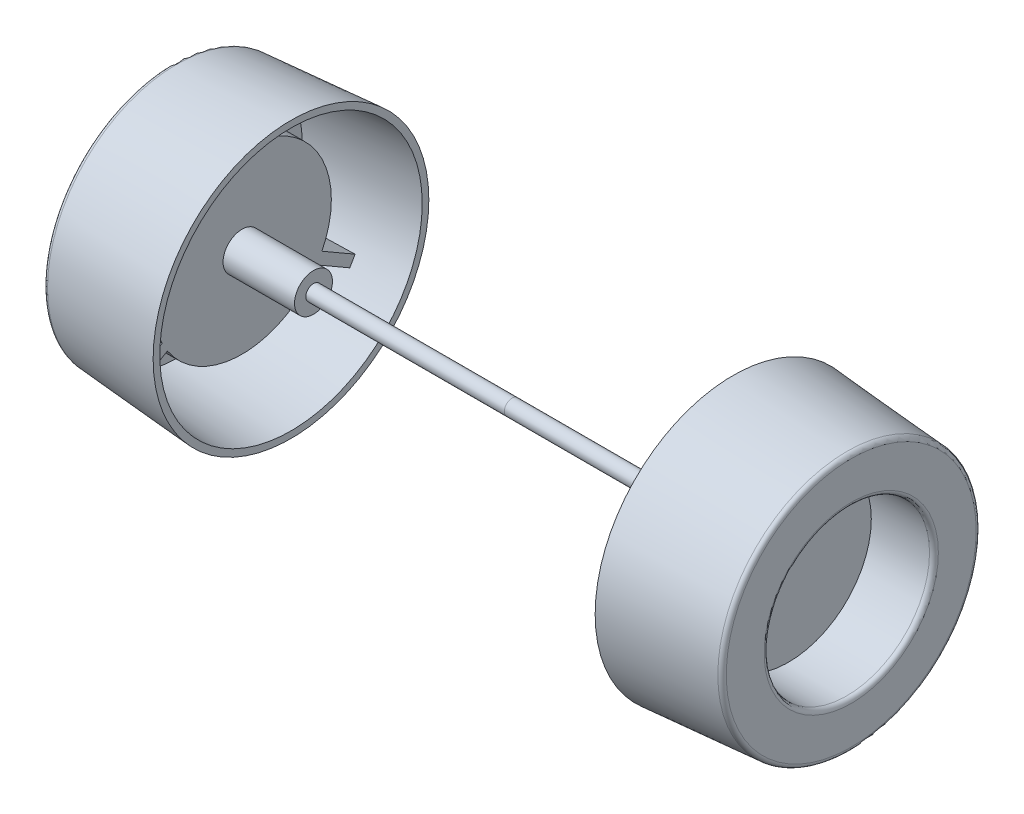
ISO-10303-21;
HEADER;
FILE_DESCRIPTION(('STEP AP214'),'2;1');
FILE_NAME('part.step','',(''),(''),'','','');
FILE_SCHEMA(('AUTOMOTIVE_DESIGN { 1 0 10303 214 1 1 1 1 }'));
ENDSEC;
DATA;
#1=APPLICATION_CONTEXT('core data for automotive mechanical design processes');
#2=APPLICATION_PROTOCOL_DEFINITION('international standard','automotive_design',2000,#1);
#3=PRODUCT_CONTEXT('',#1,'mechanical');
#4=PRODUCT('Part','Part','',(#3));
#5=PRODUCT_RELATED_PRODUCT_CATEGORY('part','',(#4));
#6=PRODUCT_DEFINITION_FORMATION('','',#4);
#7=PRODUCT_DEFINITION_CONTEXT('part definition',#1,'design');
#8=PRODUCT_DEFINITION('design','',#6,#7);
#9=PRODUCT_DEFINITION_SHAPE('','',#8);
#10=(LENGTH_UNIT() NAMED_UNIT(*) SI_UNIT(.MILLI.,.METRE.));
#11=(NAMED_UNIT(*) PLANE_ANGLE_UNIT() SI_UNIT($,.RADIAN.));
#12=(NAMED_UNIT(*) SI_UNIT($,.STERADIAN.) SOLID_ANGLE_UNIT());
#13=UNCERTAINTY_MEASURE_WITH_UNIT(LENGTH_MEASURE(1.E-05),#10,'distance_accuracy_value','');
#14=(GEOMETRIC_REPRESENTATION_CONTEXT(3) GLOBAL_UNCERTAINTY_ASSIGNED_CONTEXT((#13)) GLOBAL_UNIT_ASSIGNED_CONTEXT((#10,
#11,#12)) REPRESENTATION_CONTEXT('',''));
#15=CARTESIAN_POINT('',(0.,0.,0.));
#16=DIRECTION('',(0.,0.,1.));
#17=DIRECTION('',(1.,0.,0.));
#18=AXIS2_PLACEMENT_3D('',#15,#16,#17);
#19=CARTESIAN_POINT('',(-76.9,0.,0.));
#20=DIRECTION('',(-1.,0.,0.));
#21=DIRECTION('',(0.,0.,-1.));
#22=AXIS2_PLACEMENT_3D('',#19,#20,#21);
#23=CYLINDRICAL_SURFACE('',#22,1.745);
#24=CARTESIAN_POINT('',(-76.9,0.,0.));
#25=DIRECTION('',(-1.,0.,0.));
#26=DIRECTION('',(0.,0.,1.));
#27=AXIS2_PLACEMENT_3D('',#24,#25,#26);
#28=CIRCLE('',#27,1.745);
#29=CARTESIAN_POINT('',(-76.9,0.,-1.745));
#30=VERTEX_POINT('',#29);
#31=EDGE_CURVE('E12',#30,#30,#28,.T.);
#32=CARTESIAN_POINT('',(-121.9,0.,0.));
#33=DIRECTION('',(-1.,0.,0.));
#34=DIRECTION('',(0.,0.,1.));
#35=AXIS2_PLACEMENT_3D('',#32,#33,#34);
#36=CIRCLE('',#35,1.745);
#37=CARTESIAN_POINT('',(-121.9,0.,-1.745));
#38=VERTEX_POINT('',#37);
#39=EDGE_CURVE('E43',#38,#38,#36,.T.);
#40=CARTESIAN_POINT('',(-76.9,0.,-1.745));
#41=CARTESIAN_POINT('',(-77.36875,0.,-1.745));
#42=CARTESIAN_POINT('',(-77.8375,0.,-1.745));
#43=CARTESIAN_POINT('',(-78.775,0.,-1.745));
#44=CARTESIAN_POINT('',(-79.24375,0.,-1.745));
#45=CARTESIAN_POINT('',(-80.18125,0.,-1.745));
#46=CARTESIAN_POINT('',(-80.65,0.,-1.745));
#47=CARTESIAN_POINT('',(-81.5875,0.,-1.745));
#48=CARTESIAN_POINT('',(-82.05625,0.,-1.745));
#49=CARTESIAN_POINT('',(-82.99375,0.,-1.745));
#50=CARTESIAN_POINT('',(-83.4625,0.,-1.745));
#51=CARTESIAN_POINT('',(-84.4,0.,-1.745));
#52=CARTESIAN_POINT('',(-84.86875,0.,-1.745));
#53=CARTESIAN_POINT('',(-85.80625,0.,-1.745));
#54=CARTESIAN_POINT('',(-86.275,0.,-1.745));
#55=CARTESIAN_POINT('',(-87.2125,0.,-1.745));
#56=CARTESIAN_POINT('',(-87.68125,0.,-1.745));
#57=CARTESIAN_POINT('',(-88.61875,0.,-1.745));
#58=CARTESIAN_POINT('',(-89.0875,0.,-1.745));
#59=CARTESIAN_POINT('',(-90.025,0.,-1.745));
#60=CARTESIAN_POINT('',(-90.49375,0.,-1.745));
#61=CARTESIAN_POINT('',(-91.43125,0.,-1.745));
#62=CARTESIAN_POINT('',(-91.9,0.,-1.745));
#63=CARTESIAN_POINT('',(-92.8375,0.,-1.745));
#64=CARTESIAN_POINT('',(-93.30625,0.,-1.745));
#65=CARTESIAN_POINT('',(-94.24375,0.,-1.745));
#66=CARTESIAN_POINT('',(-94.7125,0.,-1.745));
#67=CARTESIAN_POINT('',(-95.65,0.,-1.745));
#68=CARTESIAN_POINT('',(-96.11875,0.,-1.745));
#69=CARTESIAN_POINT('',(-97.05625,0.,-1.745));
#70=CARTESIAN_POINT('',(-97.525,0.,-1.745));
#71=CARTESIAN_POINT('',(-98.4625,0.,-1.745));
#72=CARTESIAN_POINT('',(-98.93125,0.,-1.745));
#73=CARTESIAN_POINT('',(-99.86875,0.,-1.745));
#74=CARTESIAN_POINT('',(-100.3375,0.,-1.745));
#75=CARTESIAN_POINT('',(-101.275,0.,-1.745));
#76=CARTESIAN_POINT('',(-101.74375,0.,-1.745));
#77=CARTESIAN_POINT('',(-102.68125,0.,-1.745));
#78=CARTESIAN_POINT('',(-103.15,0.,-1.745));
#79=CARTESIAN_POINT('',(-104.0875,0.,-1.745));
#80=CARTESIAN_POINT('',(-104.55625,0.,-1.745));
#81=CARTESIAN_POINT('',(-105.49375,0.,-1.745));
#82=CARTESIAN_POINT('',(-105.9625,0.,-1.745));
#83=CARTESIAN_POINT('',(-106.9,0.,-1.745));
#84=CARTESIAN_POINT('',(-107.36875,0.,-1.745));
#85=CARTESIAN_POINT('',(-108.30625,0.,-1.745));
#86=CARTESIAN_POINT('',(-108.775,0.,-1.745));
#87=CARTESIAN_POINT('',(-109.7125,0.,-1.745));
#88=CARTESIAN_POINT('',(-110.18125,0.,-1.745));
#89=CARTESIAN_POINT('',(-111.11875,0.,-1.745));
#90=CARTESIAN_POINT('',(-111.5875,0.,-1.745));
#91=CARTESIAN_POINT('',(-112.525,0.,-1.745));
#92=CARTESIAN_POINT('',(-112.99375,0.,-1.745));
#93=CARTESIAN_POINT('',(-113.93125,0.,-1.745));
#94=CARTESIAN_POINT('',(-114.4,0.,-1.745));
#95=CARTESIAN_POINT('',(-115.3375,0.,-1.745));
#96=CARTESIAN_POINT('',(-115.80625,0.,-1.745));
#97=CARTESIAN_POINT('',(-116.74375,0.,-1.745));
#98=CARTESIAN_POINT('',(-117.2125,0.,-1.745));
#99=CARTESIAN_POINT('',(-118.15,0.,-1.745));
#100=CARTESIAN_POINT('',(-118.61875,0.,-1.745));
#101=CARTESIAN_POINT('',(-119.55625,0.,-1.745));
#102=CARTESIAN_POINT('',(-120.025,0.,-1.745));
#103=CARTESIAN_POINT('',(-120.9625,0.,-1.745));
#104=CARTESIAN_POINT('',(-121.43125,0.,-1.745));
#105=CARTESIAN_POINT('',(-121.9,0.,-1.745));
#106=B_SPLINE_CURVE_WITH_KNOTS('',3,(#40,#41,#42,#43,#44,#45,#46,#47,#48,#49,#50,#51,#52,#53,
#54,#55,#56,#57,#58,#59,#60,#61,#62,#63,#64,#65,#66,#67,#68,#69,#70,#71,#72,#73,#74,#75,#76,#77,
#78,#79,#80,#81,#82,#83,#84,#85,#86,#87,#88,#89,#90,#91,#92,#93,#94,#95,#96,#97,#98,#99,#100,
#101,#102,#103,#104,#105),.UNSPECIFIED.,.F.,.F.,(4,2,2,2,2,2,2,2,2,2,2,2,2,2,2,2,2,2,2,2,2,2,2,
2,2,2,2,2,2,2,2,2,4),(0.,1.40625,2.8125,4.21874999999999,5.62499999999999,7.03124999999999,
8.43749999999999,9.84375,11.25,12.65625,14.0625,15.46875,16.875,18.28125,19.6875,21.09375,22.5,
23.90625,25.3125,26.71875,28.125,29.53125,30.9375,32.34375,33.75,35.15625,36.5625,37.96875,
39.375,40.78125,42.1875,43.59375,45.),.UNSPECIFIED.);
#107=EDGE_CURVE('BSEAM37',#30,#38,#106,.T.);
#108=ORIENTED_EDGE('',*,*,#31,.T.);
#109=ORIENTED_EDGE('',*,*,#39,.F.);
#110=ORIENTED_EDGE('',*,*,#107,.T.);
#111=ORIENTED_EDGE('',*,*,#107,.F.);
#112=EDGE_LOOP('',(#108,#110,#109,#111));
#113=FACE_BOUND('',#112,.T.);
#114=ADVANCED_FACE('F37',(#113),#23,.T.);
#115=CARTESIAN_POINT('',(-76.9,0.,0.));
#116=DIRECTION('',(1.,0.,0.));
#117=DIRECTION('',(0.,0.,1.));
#118=AXIS2_PLACEMENT_3D('',#115,#116,#117);
#119=PLANE('',#118);
#120=ORIENTED_EDGE('',*,*,#31,.F.);
#121=EDGE_LOOP('',(#120));
#122=FACE_BOUND('',#121,.T.);
#123=ADVANCED_FACE('F52',(#122),#119,.T.);
#124=CARTESIAN_POINT('',(-121.9,0.,0.));
#125=DIRECTION('',(1.,0.,0.));
#126=DIRECTION('',(0.,0.,1.));
#127=AXIS2_PLACEMENT_3D('',#124,#125,#126);
#128=PLANE('',#127);
#129=ORIENTED_EDGE('',*,*,#39,.T.);
#130=EDGE_LOOP('',(#129));
#131=FACE_BOUND('',#130,.T.);
#132=ADVANCED_FACE('F49',(#131),#128,.F.);
#133=CLOSED_SHELL('',(#114,#123,#132));
#134=MANIFOLD_SOLID_BREP('B2',#133);
#135=CARTESIAN_POINT('',(-138.1,0.,0.));
#136=DIRECTION('',(-1.,0.,0.));
#137=DIRECTION('',(0.,0.,-1.));
#138=AXIS2_PLACEMENT_3D('',#135,#136,#137);
#139=PLANE('',#138);
#140=CARTESIAN_POINT('',(-138.1,0.,0.));
#141=DIRECTION('',(1.,0.,0.));
#142=DIRECTION('',(0.,0.,-1.));
#143=AXIS2_PLACEMENT_3D('',#140,#141,#142);
#144=CIRCLE('',#143,20.25);
#145=CARTESIAN_POINT('',(-138.1,20.2142743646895,1.20233602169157));
#146=VERTEX_POINT('',#145);
#147=CARTESIAN_POINT('',(-138.1,-9.06588364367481,18.1072431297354));
#148=VERTEX_POINT('',#147);
#149=EDGE_CURVE('E192',#146,#148,#144,.T.);
#150=ORIENTED_EDGE('',*,*,#149,.T.);
#151=DIRECTION('',(0.,0.500000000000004,-0.866025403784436));
#152=VECTOR('',#151,1.);
#153=CARTESIAN_POINT('',(-138.1,-9.06588364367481,18.1072431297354));
#154=LINE('',#153,#152);
#155=CARTESIAN_POINT('',(-138.1,-13.4049786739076,25.6227761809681));
#156=VERTEX_POINT('',#155);
#157=EDGE_CURVE('E441',#156,#148,#154,.T.);
#158=ORIENTED_EDGE('',*,*,#157,.F.);
#159=CARTESIAN_POINT('',(-138.1,0.,0.));
#160=DIRECTION('',(-1.,0.,0.));
#161=DIRECTION('',(0.,0.,1.));
#162=AXIS2_PLACEMENT_3D('',#159,#160,#161);
#163=CIRCLE('',#162,28.9174707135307);
#164=CARTESIAN_POINT('',(-138.1,-15.4874857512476,24.4204401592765));
#165=VERTEX_POINT('',#164);
#166=EDGE_CURVE('E268',#156,#165,#163,.F.);
#167=ORIENTED_EDGE('',*,*,#166,.T.);
#168=DIRECTION('',(0.,-0.500000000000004,0.866025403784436));
#169=VECTOR('',#168,1.);
#170=CARTESIAN_POINT('',(-138.1,-11.1483907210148,16.9049071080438));
#171=LINE('',#170,#169);
#172=CARTESIAN_POINT('',(-138.1,-11.1483907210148,16.9049071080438));
#173=VERTEX_POINT('',#172);
#174=EDGE_CURVE('E353',#173,#165,#171,.T.);
#175=ORIENTED_EDGE('',*,*,#174,.F.);
#176=CARTESIAN_POINT('',(-138.1,-11.1483907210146,-16.904907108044));
#177=VERTEX_POINT('',#176);
#178=EDGE_CURVE('E189',#173,#177,#144,.T.);
#179=ORIENTED_EDGE('',*,*,#178,.T.);
#180=DIRECTION('',(0.,0.499999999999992,0.866025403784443));
#181=VECTOR('',#180,1.);
#182=CARTESIAN_POINT('',(-138.1,-11.1483907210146,-16.904907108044));
#183=LINE('',#182,#181);
#184=CARTESIAN_POINT('',(-138.1,-15.4874857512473,-24.4204401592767));
#185=VERTEX_POINT('',#184);
#186=EDGE_CURVE('E197',#185,#177,#183,.T.);
#187=ORIENTED_EDGE('',*,*,#186,.F.);
#188=CARTESIAN_POINT('',(-138.1,0.,0.));
#189=DIRECTION('',(-1.,0.,0.));
#190=DIRECTION('',(0.,0.,1.));
#191=AXIS2_PLACEMENT_3D('',#188,#189,#190);
#192=CIRCLE('',#191,28.9174707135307);
#193=CARTESIAN_POINT('',(-138.1,-13.4049786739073,-25.6227761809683));
#194=VERTEX_POINT('',#193);
#195=EDGE_CURVE('E196',#185,#194,#192,.F.);
#196=ORIENTED_EDGE('',*,*,#195,.T.);
#197=DIRECTION('',(0.,-0.499999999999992,-0.866025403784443));
#198=VECTOR('',#197,1.);
#199=CARTESIAN_POINT('',(-138.1,-9.06588364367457,-18.1072431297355));
#200=LINE('',#199,#198);
#201=CARTESIAN_POINT('',(-138.1,-9.06588364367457,-18.1072431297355));
#202=VERTEX_POINT('',#201);
#203=EDGE_CURVE('E172',#202,#194,#200,.T.);
#204=ORIENTED_EDGE('',*,*,#203,.F.);
#205=CARTESIAN_POINT('',(-138.1,20.2142743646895,-1.20233602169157));
#206=VERTEX_POINT('',#205);
#207=EDGE_CURVE('E180',#202,#206,#144,.T.);
#208=ORIENTED_EDGE('',*,*,#207,.T.);
#209=DIRECTION('',(0.,-1.,0.));
#210=VECTOR('',#209,1.);
#211=CARTESIAN_POINT('',(-138.1,20.2142743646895,-1.20233602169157));
#212=LINE('',#211,#210);
#213=CARTESIAN_POINT('',(-138.1,28.892464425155,-1.20233602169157));
#214=VERTEX_POINT('',#213);
#215=EDGE_CURVE('E431',#214,#206,#212,.T.);
#216=ORIENTED_EDGE('',*,*,#215,.F.);
#217=CARTESIAN_POINT('',(-138.1,0.,0.));
#218=DIRECTION('',(-1.,0.,0.));
#219=DIRECTION('',(0.,0.,1.));
#220=AXIS2_PLACEMENT_3D('',#217,#218,#219);
#221=CIRCLE('',#220,28.9174707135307);
#222=CARTESIAN_POINT('',(-138.1,28.892464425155,1.20233602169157));
#223=VERTEX_POINT('',#222);
#224=EDGE_CURVE('E417',#214,#223,#221,.F.);
#225=ORIENTED_EDGE('',*,*,#224,.T.);
#226=DIRECTION('',(0.,1.,0.));
#227=VECTOR('',#226,1.);
#228=CARTESIAN_POINT('',(-138.1,20.2142743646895,1.20233602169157));
#229=LINE('',#228,#227);
#230=EDGE_CURVE('E433',#146,#223,#229,.T.);
#231=ORIENTED_EDGE('',*,*,#230,.F.);
#232=EDGE_LOOP('',(#150,#158,#167,#175,#179,#187,#196,#204,#208,#216,#225,#231));
#233=FACE_BOUND('',#232,.T.);
#234=CARTESIAN_POINT('',(-138.1,0.,0.));
#235=DIRECTION('',(1.,0.,0.));
#236=DIRECTION('',(0.,0.,-1.));
#237=AXIS2_PLACEMENT_3D('',#234,#235,#236);
#238=CIRCLE('',#237,4.3);
#239=CARTESIAN_POINT('',(-138.1,0.,-4.3));
#240=VERTEX_POINT('',#239);
#241=EDGE_CURVE('E463',#240,#240,#238,.F.);
#242=ORIENTED_EDGE('',*,*,#241,.T.);
#243=EDGE_LOOP('',(#242));
#244=FACE_BOUND('',#243,.T.);
#245=ADVANCED_FACE('F79',(#233,#244),#139,.F.);
#246=CARTESIAN_POINT('',(-153.688370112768,0.,0.));
#247=DIRECTION('',(1.,0.,0.));
#248=DIRECTION('',(0.,0.,1.));
#249=AXIS2_PLACEMENT_3D('',#246,#247,#248);
#250=CONICAL_SURFACE('',#249,27.7541595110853,0.0744887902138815);
#251=CARTESIAN_POINT('',(-146.1,0.,0.));
#252=DIRECTION('',(-1.,0.,0.));
#253=DIRECTION('',(0.,0.,1.));
#254=AXIS2_PLACEMENT_3D('',#251,#252,#253);
#255=CIRCLE('',#254,28.3204557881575);
#256=CARTESIAN_POINT('',(-146.1,-13.1062074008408,25.1052891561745));
#257=VERTEX_POINT('',#256);
#258=CARTESIAN_POINT('',(-146.1,-15.1887144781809,23.9029531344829));
#259=VERTEX_POINT('',#258);
#260=EDGE_CURVE('E434',#257,#259,#255,.F.);
#261=ORIENTED_EDGE('',*,*,#260,.T.);
#262=CARTESIAN_POINT('',(-138.0998,-15.4874932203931,24.420453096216));
#263=CARTESIAN_POINT('',(-139.433200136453,-15.4376964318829,24.3342025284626));
#264=CARTESIAN_POINT('',(-140.76660020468,-15.3878991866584,24.2479511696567));
#265=CARTESIAN_POINT('',(-143.43340020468,-15.2883037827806,24.0754468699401));
#266=CARTESIAN_POINT('',(-144.766800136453,-15.2385056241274,23.9891939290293));
#267=CARTESIAN_POINT('',(-146.1002,-15.1887070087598,23.9029401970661));
#268=B_SPLINE_CURVE_WITH_KNOTS('',3,(#262,#263,#264,#265,#266,#267),.UNSPECIFIED.,.F.,.F.,(4,2,
4),(0.,4.01134307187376,8.02268614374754),.UNSPECIFIED.);
#269=EDGE_CURVE('E255',#165,#259,#268,.T.);
#270=ORIENTED_EDGE('',*,*,#269,.F.);
#271=ORIENTED_EDGE('',*,*,#166,.F.);
#272=CARTESIAN_POINT('',(-146.1002,-13.1061999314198,25.1052762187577));
#273=CARTESIAN_POINT('',(-144.766800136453,-13.1559985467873,25.1915299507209));
#274=CARTESIAN_POINT('',(-143.43340020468,-13.2057967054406,25.2777828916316));
#275=CARTESIAN_POINT('',(-140.76660020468,-13.3053921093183,25.4502871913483));
#276=CARTESIAN_POINT('',(-139.433200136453,-13.3551893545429,25.5365385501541));
#277=CARTESIAN_POINT('',(-138.0998,-13.4049861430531,25.6227891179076));
#278=B_SPLINE_CURVE_WITH_KNOTS('',3,(#272,#273,#274,#275,#276,#277),.UNSPECIFIED.,.F.,.F.,(4,2,
4),(0.,4.01134307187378,8.02268614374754),.UNSPECIFIED.);
#279=EDGE_CURVE('E262',#257,#156,#278,.T.);
#280=ORIENTED_EDGE('',*,*,#279,.F.);
#281=EDGE_LOOP('',(#261,#270,#271,#280));
#282=FACE_BOUND('',#281,.T.);
#283=CARTESIAN_POINT('',(-152.3,0.,0.));
#284=DIRECTION('',(1.,0.,0.));
#285=DIRECTION('',(0.,0.,-1.));
#286=AXIS2_PLACEMENT_3D('',#283,#284,#285);
#287=CIRCLE('',#286,27.8577692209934);
#288=CARTESIAN_POINT('',(-152.3,0.,-27.8577692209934));
#289=VERTEX_POINT('',#288);
#290=EDGE_CURVE('E355',#289,#289,#287,.T.);
#291=ORIENTED_EDGE('',*,*,#290,.F.);
#292=EDGE_LOOP('',(#291));
#293=FACE_BOUND('',#292,.T.);
#294=CARTESIAN_POINT('',(-127.,0.,0.));
#295=DIRECTION('',(1.,0.,0.));
#296=DIRECTION('',(0.,0.,-1.));
#297=AXIS2_PLACEMENT_3D('',#294,#295,#296);
#298=CIRCLE('',#297,29.7458289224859);
#299=CARTESIAN_POINT('',(-127.,0.,-29.7458289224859));
#300=VERTEX_POINT('',#299);
#301=EDGE_CURVE('E359',#300,#300,#298,.T.);
#302=ORIENTED_EDGE('',*,*,#301,.T.);
#303=EDGE_LOOP('',(#302));
#304=FACE_BOUND('',#303,.T.);
#305=CARTESIAN_POINT('',(-146.1,0.,0.));
#306=DIRECTION('',(-1.,0.,0.));
#307=DIRECTION('',(0.,0.,1.));
#308=AXIS2_PLACEMENT_3D('',#305,#306,#307);
#309=CIRCLE('',#308,28.3204557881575);
#310=CARTESIAN_POINT('',(-146.1,28.2949218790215,-1.20233602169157));
#311=VERTEX_POINT('',#310);
#312=CARTESIAN_POINT('',(-146.1,28.2949218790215,1.20233602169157));
#313=VERTEX_POINT('',#312);
#314=EDGE_CURVE('E414',#311,#313,#309,.F.);
#315=ORIENTED_EDGE('',*,*,#314,.T.);
#316=CARTESIAN_POINT('',(-116.025197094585,30.5411866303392,1.20233602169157));
#317=CARTESIAN_POINT('',(-123.723848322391,29.9662187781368,1.20233602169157));
#318=CARTESIAN_POINT('',(-131.422497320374,29.3912210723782,1.20233602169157));
#319=CARTESIAN_POINT('',(-146.81979085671,28.2411659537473,1.20233602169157));
#320=CARTESIAN_POINT('',(-154.518435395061,27.6661085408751,1.20233602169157));
#321=CARTESIAN_POINT('',(-162.21707770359,27.0910212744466,1.20233602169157));
#322=B_SPLINE_CURVE_WITH_KNOTS('',3,(#316,#317,#318,#319,#320,#321),.UNSPECIFIED.,.F.,.F.,(4,2,
4),(0.,23.1602756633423,46.3205513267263),.UNSPECIFIED.);
#323=EDGE_CURVE('E239',#223,#313,#322,.T.);
#324=ORIENTED_EDGE('',*,*,#323,.F.);
#325=ORIENTED_EDGE('',*,*,#224,.F.);
#326=CARTESIAN_POINT('',(-162.21707770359,27.0910212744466,-1.20233602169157));
#327=CARTESIAN_POINT('',(-154.518435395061,27.6661085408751,-1.20233602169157));
#328=CARTESIAN_POINT('',(-146.81979085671,28.2411659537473,-1.20233602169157));
#329=CARTESIAN_POINT('',(-131.422497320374,29.3912210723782,-1.20233602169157));
#330=CARTESIAN_POINT('',(-123.723848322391,29.9662187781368,-1.20233602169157));
#331=CARTESIAN_POINT('',(-116.025197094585,30.5411866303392,-1.20233602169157));
#332=B_SPLINE_CURVE_WITH_KNOTS('',3,(#326,#327,#328,#329,#330,#331),.UNSPECIFIED.,.F.,.F.,(4,2,
4),(0.,23.160275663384,46.3205513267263),.UNSPECIFIED.);
#333=EDGE_CURVE('E247',#311,#214,#332,.T.);
#334=ORIENTED_EDGE('',*,*,#333,.F.);
#335=EDGE_LOOP('',(#315,#324,#325,#334));
#336=FACE_BOUND('',#335,.T.);
#337=CARTESIAN_POINT('',(-146.1,0.,0.));
#338=DIRECTION('',(-1.,0.,0.));
#339=DIRECTION('',(0.,0.,1.));
#340=AXIS2_PLACEMENT_3D('',#337,#338,#339);
#341=CIRCLE('',#340,28.3204557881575);
#342=CARTESIAN_POINT('',(-146.1,-15.1887144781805,-23.9029531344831));
#343=VERTEX_POINT('',#342);
#344=CARTESIAN_POINT('',(-146.1,-13.1062074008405,-25.1052891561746));
#345=VERTEX_POINT('',#344);
#346=EDGE_CURVE('E348',#343,#345,#341,.F.);
#347=ORIENTED_EDGE('',*,*,#346,.T.);
#348=CARTESIAN_POINT('',(-138.0998,-13.4049861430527,-25.6227891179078));
#349=CARTESIAN_POINT('',(-139.433200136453,-13.3551893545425,-25.5365385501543));
#350=CARTESIAN_POINT('',(-140.76660020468,-13.305392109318,-25.4502871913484));
#351=CARTESIAN_POINT('',(-143.43340020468,-13.2057967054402,-25.2777828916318));
#352=CARTESIAN_POINT('',(-144.766800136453,-13.155998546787,-25.1915299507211));
#353=CARTESIAN_POINT('',(-146.1002,-13.1061999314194,-25.1052762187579));
#354=B_SPLINE_CURVE_WITH_KNOTS('',3,(#348,#349,#350,#351,#352,#353),.UNSPECIFIED.,.F.,.F.,(4,2,
4),(0.,4.01134307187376,8.02268614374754),.UNSPECIFIED.);
#355=EDGE_CURVE('E95',#194,#345,#354,.T.);
#356=ORIENTED_EDGE('',*,*,#355,.F.);
#357=ORIENTED_EDGE('',*,*,#195,.F.);
#358=CARTESIAN_POINT('',(-146.1002,-15.1887070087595,-23.9029401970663));
#359=CARTESIAN_POINT('',(-144.766800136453,-15.238505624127,-23.9891939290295));
#360=CARTESIAN_POINT('',(-143.43340020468,-15.2883037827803,-24.0754468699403));
#361=CARTESIAN_POINT('',(-140.76660020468,-15.387899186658,-24.2479511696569));
#362=CARTESIAN_POINT('',(-139.433200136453,-15.4376964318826,-24.3342025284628));
#363=CARTESIAN_POINT('',(-138.0998,-15.4874932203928,-24.4204530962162));
#364=B_SPLINE_CURVE_WITH_KNOTS('',3,(#358,#359,#360,#361,#362,#363),.UNSPECIFIED.,.F.,.F.,(4,2,
4),(0.,4.01134307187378,8.02268614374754),.UNSPECIFIED.);
#365=EDGE_CURVE('E218',#343,#185,#364,.T.);
#366=ORIENTED_EDGE('',*,*,#365,.F.);
#367=EDGE_LOOP('',(#347,#356,#357,#366));
#368=FACE_BOUND('',#367,.T.);
#369=ADVANCED_FACE('F226',(#282,#293,#304,#336,#368),#250,.F.);
#370=CARTESIAN_POINT('',(-153.8,0.,0.));
#371=DIRECTION('',(-1.,0.,0.));
#372=DIRECTION('',(0.,0.,-1.));
#373=AXIS2_PLACEMENT_3D('',#370,#371,#372);
#374=PLANE('',#373);
#375=CARTESIAN_POINT('',(-153.8,0.,0.));
#376=DIRECTION('',(1.,0.,0.));
#377=DIRECTION('',(0.,0.,-1.));
#378=AXIS2_PLACEMENT_3D('',#375,#376,#377);
#379=CIRCLE('',#378,19.75);
#380=CARTESIAN_POINT('',(-153.8,0.,-19.75));
#381=VERTEX_POINT('',#380);
#382=EDGE_CURVE('E88',#381,#381,#379,.F.);
#383=ORIENTED_EDGE('',*,*,#382,.F.);
#384=EDGE_LOOP('',(#383));
#385=FACE_BOUND('',#384,.T.);
#386=CARTESIAN_POINT('',(-153.8,0.,0.));
#387=DIRECTION('',(1.,0.,0.));
#388=DIRECTION('',(0.,0.,-1.));
#389=AXIS2_PLACEMENT_3D('',#386,#387,#388);
#390=CIRCLE('',#389,28.3218461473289);
#391=CARTESIAN_POINT('',(-153.8,0.,-28.3218461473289));
#392=VERTEX_POINT('',#391);
#393=EDGE_CURVE('E475',#392,#392,#390,.T.);
#394=ORIENTED_EDGE('',*,*,#393,.F.);
#395=EDGE_LOOP('',(#394));
#396=FACE_BOUND('',#395,.T.);
#397=ADVANCED_FACE('F231',(#385,#396),#374,.T.);
#398=CARTESIAN_POINT('',(-127.,0.,0.));
#399=DIRECTION('',(-1.,0.,0.));
#400=DIRECTION('',(0.,0.,-1.));
#401=AXIS2_PLACEMENT_3D('',#398,#399,#400);
#402=PLANE('',#401);
#403=ORIENTED_EDGE('',*,*,#301,.F.);
#404=EDGE_LOOP('',(#403));
#405=FACE_BOUND('',#404,.T.);
#406=CARTESIAN_POINT('',(-127.,0.,0.));
#407=DIRECTION('',(1.,0.,0.));
#408=DIRECTION('',(0.,0.,-1.));
#409=AXIS2_PLACEMENT_3D('',#406,#407,#408);
#410=CIRCLE('',#409,31.25);
#411=CARTESIAN_POINT('',(-127.,0.,-31.25));
#412=VERTEX_POINT('',#411);
#413=EDGE_CURVE('E365',#412,#412,#410,.T.);
#414=ORIENTED_EDGE('',*,*,#413,.T.);
#415=EDGE_LOOP('',(#414));
#416=FACE_BOUND('',#415,.T.);
#417=ADVANCED_FACE('F81',(#405,#416),#402,.F.);
#418=CARTESIAN_POINT('',(-153.8,0.,0.));
#419=DIRECTION('',(1.,0.,0.));
#420=DIRECTION('',(0.,0.,1.));
#421=AXIS2_PLACEMENT_3D('',#418,#419,#420);
#422=CONICAL_SURFACE('',#421,29.25,0.0744887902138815);
#423=CARTESIAN_POINT('',(-152.874419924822,0.,0.));
#424=DIRECTION('',(1.,0.,0.));
#425=DIRECTION('',(0.,0.,-1.));
#426=AXIS2_PLACEMENT_3D('',#423,#424,#425);
#427=CIRCLE('',#426,29.3190731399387);
#428=CARTESIAN_POINT('',(-152.874419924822,0.,-29.3190731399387));
#429=VERTEX_POINT('',#428);
#430=EDGE_CURVE('E35',#429,#429,#427,.F.);
#431=ORIENTED_EDGE('',*,*,#430,.F.);
#432=EDGE_LOOP('',(#431));
#433=FACE_BOUND('',#432,.T.);
#434=ORIENTED_EDGE('',*,*,#413,.F.);
#435=EDGE_LOOP('',(#434));
#436=FACE_BOUND('',#435,.T.);
#437=ADVANCED_FACE('F374',(#433,#436),#422,.T.);
#438=CARTESIAN_POINT('',(-139.6,0.,0.));
#439=DIRECTION('',(-1.,0.,0.));
#440=DIRECTION('',(0.,0.,-1.));
#441=AXIS2_PLACEMENT_3D('',#438,#439,#440);
#442=CYLINDRICAL_SURFACE('',#441,18.75);
#443=CARTESIAN_POINT('',(-152.8,0.,0.));
#444=DIRECTION('',(1.,0.,0.));
#445=DIRECTION('',(0.,0.,-1.));
#446=AXIS2_PLACEMENT_3D('',#443,#444,#445);
#447=CIRCLE('',#446,18.75);
#448=CARTESIAN_POINT('',(-152.8,0.,-18.75));
#449=VERTEX_POINT('',#448);
#450=EDGE_CURVE('E466',#449,#449,#447,.T.);
#451=ORIENTED_EDGE('',*,*,#450,.F.);
#452=EDGE_LOOP('',(#451));
#453=FACE_BOUND('',#452,.T.);
#454=CARTESIAN_POINT('',(-139.6,0.,0.));
#455=DIRECTION('',(1.,0.,0.));
#456=DIRECTION('',(0.,0.,-1.));
#457=AXIS2_PLACEMENT_3D('',#454,#455,#456);
#458=CIRCLE('',#457,18.75);
#459=CARTESIAN_POINT('',(-139.6,0.,-18.75));
#460=VERTEX_POINT('',#459);
#461=EDGE_CURVE('E362',#460,#460,#458,.T.);
#462=ORIENTED_EDGE('',*,*,#461,.T.);
#463=EDGE_LOOP('',(#462));
#464=FACE_BOUND('',#463,.T.);
#465=ADVANCED_FACE('F383',(#453,#464),#442,.F.);
#466=CARTESIAN_POINT('',(-139.6,0.,0.));
#467=DIRECTION('',(-1.,0.,0.));
#468=DIRECTION('',(0.,0.,-1.));
#469=AXIS2_PLACEMENT_3D('',#466,#467,#468);
#470=PLANE('',#469);
#471=ORIENTED_EDGE('',*,*,#461,.F.);
#472=EDGE_LOOP('',(#471));
#473=FACE_BOUND('',#472,.T.);
#474=ADVANCED_FACE('F389',(#473),#470,.T.);
#475=CARTESIAN_POINT('',(-152.3,0.,0.));
#476=DIRECTION('',(-1.,0.,0.));
#477=DIRECTION('',(0.,0.,-1.));
#478=AXIS2_PLACEMENT_3D('',#475,#476,#477);
#479=PLANE('',#478);
#480=CARTESIAN_POINT('',(-152.3,0.,0.));
#481=DIRECTION('',(1.,0.,0.));
#482=DIRECTION('',(0.,0.,-1.));
#483=AXIS2_PLACEMENT_3D('',#480,#481,#482);
#484=CIRCLE('',#483,20.25);
#485=CARTESIAN_POINT('',(-152.3,0.,-20.25));
#486=VERTEX_POINT('',#485);
#487=EDGE_CURVE('E190',#486,#486,#484,.T.);
#488=ORIENTED_EDGE('',*,*,#487,.F.);
#489=EDGE_LOOP('',(#488));
#490=FACE_BOUND('',#489,.T.);
#491=ORIENTED_EDGE('',*,*,#290,.T.);
#492=EDGE_LOOP('',(#491));
#493=FACE_BOUND('',#492,.T.);
#494=ADVANCED_FACE('F233',(#490,#493),#479,.F.);
#495=CARTESIAN_POINT('',(-139.6,0.,0.));
#496=DIRECTION('',(-1.,0.,0.));
#497=DIRECTION('',(0.,0.,-1.));
#498=AXIS2_PLACEMENT_3D('',#495,#496,#497);
#499=CYLINDRICAL_SURFACE('',#498,20.25);
#500=DIRECTION('',(1.,0.,0.));
#501=VECTOR('',#500,1.);
#502=CARTESIAN_POINT('',(-146.1,-11.1483907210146,-16.904907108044));
#503=LINE('',#502,#501);
#504=CARTESIAN_POINT('',(-146.1,-11.1483907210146,-16.904907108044));
#505=VERTEX_POINT('',#504);
#506=EDGE_CURVE('E176',#505,#177,#503,.T.);
#507=ORIENTED_EDGE('',*,*,#506,.T.);
#508=ORIENTED_EDGE('',*,*,#178,.F.);
#509=DIRECTION('',(1.,0.,0.));
#510=VECTOR('',#509,1.);
#511=CARTESIAN_POINT('',(-146.1,-11.1483907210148,16.9049071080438));
#512=LINE('',#511,#510);
#513=CARTESIAN_POINT('',(-146.1,-11.1483907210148,16.9049071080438));
#514=VERTEX_POINT('',#513);
#515=EDGE_CURVE('E444',#514,#173,#512,.T.);
#516=ORIENTED_EDGE('',*,*,#515,.F.);
#517=CARTESIAN_POINT('',(-146.1,0.,0.));
#518=DIRECTION('',(1.,0.,0.));
#519=DIRECTION('',(0.,0.,1.));
#520=AXIS2_PLACEMENT_3D('',#517,#518,#519);
#521=CIRCLE('',#520,20.25);
#522=CARTESIAN_POINT('',(-146.1,-9.06588364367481,18.1072431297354));
#523=VERTEX_POINT('',#522);
#524=EDGE_CURVE('E446',#523,#514,#521,.T.);
#525=ORIENTED_EDGE('',*,*,#524,.F.);
#526=DIRECTION('',(1.,0.,0.));
#527=VECTOR('',#526,1.);
#528=CARTESIAN_POINT('',(-146.1,-9.06588364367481,18.1072431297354));
#529=LINE('',#528,#527);
#530=EDGE_CURVE('E443',#523,#148,#529,.T.);
#531=ORIENTED_EDGE('',*,*,#530,.T.);
#532=ORIENTED_EDGE('',*,*,#149,.F.);
#533=DIRECTION('',(1.,0.,0.));
#534=VECTOR('',#533,1.);
#535=CARTESIAN_POINT('',(-146.1,20.2142743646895,1.20233602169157));
#536=LINE('',#535,#534);
#537=CARTESIAN_POINT('',(-146.1,20.2142743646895,1.20233602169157));
#538=VERTEX_POINT('',#537);
#539=EDGE_CURVE('E421',#538,#146,#536,.T.);
#540=ORIENTED_EDGE('',*,*,#539,.F.);
#541=CARTESIAN_POINT('',(-146.1,0.,0.));
#542=DIRECTION('',(1.,0.,0.));
#543=DIRECTION('',(0.,0.,1.));
#544=AXIS2_PLACEMENT_3D('',#541,#542,#543);
#545=CIRCLE('',#544,20.25);
#546=CARTESIAN_POINT('',(-146.1,20.2142743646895,-1.20233602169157));
#547=VERTEX_POINT('',#546);
#548=EDGE_CURVE('E428',#547,#538,#545,.T.);
#549=ORIENTED_EDGE('',*,*,#548,.F.);
#550=DIRECTION('',(1.,0.,0.));
#551=VECTOR('',#550,1.);
#552=CARTESIAN_POINT('',(-146.1,20.2142743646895,-1.20233602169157));
#553=LINE('',#552,#551);
#554=EDGE_CURVE('E185',#547,#206,#553,.T.);
#555=ORIENTED_EDGE('',*,*,#554,.T.);
#556=ORIENTED_EDGE('',*,*,#207,.F.);
#557=DIRECTION('',(1.,0.,0.));
#558=VECTOR('',#557,1.);
#559=CARTESIAN_POINT('',(-146.1,-9.06588364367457,-18.1072431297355));
#560=LINE('',#559,#558);
#561=CARTESIAN_POINT('',(-146.1,-9.06588364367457,-18.1072431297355));
#562=VERTEX_POINT('',#561);
#563=EDGE_CURVE('E168',#562,#202,#560,.T.);
#564=ORIENTED_EDGE('',*,*,#563,.F.);
#565=CARTESIAN_POINT('',(-146.1,0.,0.));
#566=DIRECTION('',(1.,0.,0.));
#567=DIRECTION('',(0.,0.,1.));
#568=AXIS2_PLACEMENT_3D('',#565,#566,#567);
#569=CIRCLE('',#568,20.25);
#570=EDGE_CURVE('E201',#505,#562,#569,.T.);
#571=ORIENTED_EDGE('',*,*,#570,.F.);
#572=EDGE_LOOP('',(#507,#508,#516,#525,#531,#532,#540,#549,#555,#556,#564,#571));
#573=FACE_BOUND('',#572,.T.);
#574=ORIENTED_EDGE('',*,*,#487,.T.);
#575=EDGE_LOOP('',(#574));
#576=FACE_BOUND('',#575,.T.);
#577=ADVANCED_FACE('F181',(#573,#576),#499,.T.);
#578=CARTESIAN_POINT('',(-146.1,0.,0.));
#579=DIRECTION('',(1.,0.,0.));
#580=DIRECTION('',(0.,0.,1.));
#581=AXIS2_PLACEMENT_3D('',#578,#579,#580);
#582=PLANE('',#581);
#583=DIRECTION('',(0.,-1.,0.));
#584=VECTOR('',#583,1.);
#585=CARTESIAN_POINT('',(-146.1,20.2142743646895,-1.20233602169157));
#586=LINE('',#585,#584);
#587=EDGE_CURVE('E423',#311,#547,#586,.T.);
#588=ORIENTED_EDGE('',*,*,#587,.T.);
#589=ORIENTED_EDGE('',*,*,#548,.T.);
#590=DIRECTION('',(0.,1.,0.));
#591=VECTOR('',#590,1.);
#592=CARTESIAN_POINT('',(-146.1,20.2142743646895,1.20233602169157));
#593=LINE('',#592,#591);
#594=EDGE_CURVE('E426',#538,#313,#593,.T.);
#595=ORIENTED_EDGE('',*,*,#594,.T.);
#596=ORIENTED_EDGE('',*,*,#314,.F.);
#597=EDGE_LOOP('',(#588,#589,#595,#596));
#598=FACE_BOUND('',#597,.T.);
#599=ADVANCED_FACE('F281',(#598),#582,.F.);
#600=CARTESIAN_POINT('',(-146.1,20.2142743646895,-1.20233602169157));
#601=DIRECTION('',(0.,0.,-1.));
#602=DIRECTION('',(1.,0.,0.));
#603=AXIS2_PLACEMENT_3D('',#600,#601,#602);
#604=PLANE('',#603);
#605=ORIENTED_EDGE('',*,*,#333,.T.);
#606=ORIENTED_EDGE('',*,*,#215,.T.);
#607=ORIENTED_EDGE('',*,*,#554,.F.);
#608=ORIENTED_EDGE('',*,*,#587,.F.);
#609=EDGE_LOOP('',(#605,#606,#607,#608));
#610=FACE_BOUND('',#609,.T.);
#611=ADVANCED_FACE('F283',(#610),#604,.T.);
#612=CARTESIAN_POINT('',(-146.1,20.2142743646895,1.20233602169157));
#613=DIRECTION('',(0.,0.,1.));
#614=DIRECTION('',(-1.,0.,0.));
#615=AXIS2_PLACEMENT_3D('',#612,#613,#614);
#616=PLANE('',#615);
#617=ORIENTED_EDGE('',*,*,#323,.T.);
#618=ORIENTED_EDGE('',*,*,#594,.F.);
#619=ORIENTED_EDGE('',*,*,#539,.T.);
#620=ORIENTED_EDGE('',*,*,#230,.T.);
#621=EDGE_LOOP('',(#617,#618,#619,#620));
#622=FACE_BOUND('',#621,.T.);
#623=ADVANCED_FACE('F287',(#622),#616,.T.);
#624=CARTESIAN_POINT('',(-146.1,0.,0.));
#625=DIRECTION('',(1.,0.,0.));
#626=DIRECTION('',(0.,0.,1.));
#627=AXIS2_PLACEMENT_3D('',#624,#625,#626);
#628=PLANE('',#627);
#629=DIRECTION('',(0.,0.500000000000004,-0.866025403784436));
#630=VECTOR('',#629,1.);
#631=CARTESIAN_POINT('',(-146.1,-9.06588364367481,18.1072431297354));
#632=LINE('',#631,#630);
#633=EDGE_CURVE('E454',#257,#523,#632,.T.);
#634=ORIENTED_EDGE('',*,*,#633,.T.);
#635=ORIENTED_EDGE('',*,*,#524,.T.);
#636=DIRECTION('',(0.,-0.500000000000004,0.866025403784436));
#637=VECTOR('',#636,1.);
#638=CARTESIAN_POINT('',(-146.1,-11.1483907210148,16.9049071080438));
#639=LINE('',#638,#637);
#640=EDGE_CURVE('E452',#514,#259,#639,.T.);
#641=ORIENTED_EDGE('',*,*,#640,.T.);
#642=ORIENTED_EDGE('',*,*,#260,.F.);
#643=EDGE_LOOP('',(#634,#635,#641,#642));
#644=FACE_BOUND('',#643,.T.);
#645=ADVANCED_FACE('F274',(#644),#628,.F.);
#646=CARTESIAN_POINT('',(-146.1,-9.06588364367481,18.1072431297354));
#647=DIRECTION('',(0.,0.866025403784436,0.500000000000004));
#648=DIRECTION('',(0.,-0.500000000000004,0.866025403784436));
#649=AXIS2_PLACEMENT_3D('',#646,#647,#648);
#650=PLANE('',#649);
#651=ORIENTED_EDGE('',*,*,#279,.T.);
#652=ORIENTED_EDGE('',*,*,#157,.T.);
#653=ORIENTED_EDGE('',*,*,#530,.F.);
#654=ORIENTED_EDGE('',*,*,#633,.F.);
#655=EDGE_LOOP('',(#651,#652,#653,#654));
#656=FACE_BOUND('',#655,.T.);
#657=ADVANCED_FACE('F270',(#656),#650,.T.);
#658=CARTESIAN_POINT('',(-146.1,-11.1483907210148,16.9049071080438));
#659=DIRECTION('',(0.,-0.866025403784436,-0.500000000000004));
#660=DIRECTION('',(0.,0.500000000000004,-0.866025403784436));
#661=AXIS2_PLACEMENT_3D('',#658,#659,#660);
#662=PLANE('',#661);
#663=ORIENTED_EDGE('',*,*,#269,.T.);
#664=ORIENTED_EDGE('',*,*,#640,.F.);
#665=ORIENTED_EDGE('',*,*,#515,.T.);
#666=ORIENTED_EDGE('',*,*,#174,.T.);
#667=EDGE_LOOP('',(#663,#664,#665,#666));
#668=FACE_BOUND('',#667,.T.);
#669=ADVANCED_FACE('F273',(#668),#662,.T.);
#670=CARTESIAN_POINT('',(-146.1,0.,0.));
#671=DIRECTION('',(1.,0.,0.));
#672=DIRECTION('',(0.,0.,1.));
#673=AXIS2_PLACEMENT_3D('',#670,#671,#672);
#674=PLANE('',#673);
#675=DIRECTION('',(0.,0.499999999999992,0.866025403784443));
#676=VECTOR('',#675,1.);
#677=CARTESIAN_POINT('',(-146.1,-11.1483907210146,-16.904907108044));
#678=LINE('',#677,#676);
#679=EDGE_CURVE('E177',#343,#505,#678,.T.);
#680=ORIENTED_EDGE('',*,*,#679,.T.);
#681=ORIENTED_EDGE('',*,*,#570,.T.);
#682=DIRECTION('',(0.,-0.499999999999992,-0.866025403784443));
#683=VECTOR('',#682,1.);
#684=CARTESIAN_POINT('',(-146.1,-9.06588364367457,-18.1072431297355));
#685=LINE('',#684,#683);
#686=EDGE_CURVE('E102',#562,#345,#685,.T.);
#687=ORIENTED_EDGE('',*,*,#686,.T.);
#688=ORIENTED_EDGE('',*,*,#346,.F.);
#689=EDGE_LOOP('',(#680,#681,#687,#688));
#690=FACE_BOUND('',#689,.T.);
#691=ADVANCED_FACE('F279',(#690),#674,.F.);
#692=CARTESIAN_POINT('',(-146.1,-11.1483907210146,-16.904907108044));
#693=DIRECTION('',(0.,-0.866025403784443,0.499999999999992));
#694=DIRECTION('',(0.,-0.499999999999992,-0.866025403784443));
#695=AXIS2_PLACEMENT_3D('',#692,#693,#694);
#696=PLANE('',#695);
#697=ORIENTED_EDGE('',*,*,#365,.T.);
#698=ORIENTED_EDGE('',*,*,#186,.T.);
#699=ORIENTED_EDGE('',*,*,#506,.F.);
#700=ORIENTED_EDGE('',*,*,#679,.F.);
#701=EDGE_LOOP('',(#697,#698,#699,#700));
#702=FACE_BOUND('',#701,.T.);
#703=ADVANCED_FACE('F334',(#702),#696,.T.);
#704=CARTESIAN_POINT('',(-146.1,-9.06588364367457,-18.1072431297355));
#705=DIRECTION('',(0.,0.866025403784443,-0.499999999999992));
#706=DIRECTION('',(0.,0.499999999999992,0.866025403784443));
#707=AXIS2_PLACEMENT_3D('',#704,#705,#706);
#708=PLANE('',#707);
#709=ORIENTED_EDGE('',*,*,#355,.T.);
#710=ORIENTED_EDGE('',*,*,#686,.F.);
#711=ORIENTED_EDGE('',*,*,#563,.T.);
#712=ORIENTED_EDGE('',*,*,#203,.T.);
#713=EDGE_LOOP('',(#709,#710,#711,#712));
#714=FACE_BOUND('',#713,.T.);
#715=ADVANCED_FACE('F170',(#714),#708,.T.);
#716=CARTESIAN_POINT('',(-121.9,0.,0.));
#717=DIRECTION('',(1.,0.,0.));
#718=DIRECTION('',(0.,0.,1.));
#719=AXIS2_PLACEMENT_3D('',#716,#717,#718);
#720=PLANE('',#719);
#721=CARTESIAN_POINT('',(-121.9,0.,0.));
#722=DIRECTION('',(-1.,0.,0.));
#723=DIRECTION('',(0.,0.,1.));
#724=AXIS2_PLACEMENT_3D('',#721,#722,#723);
#725=CIRCLE('',#724,4.3);
#726=CARTESIAN_POINT('',(-121.9,0.,4.3));
#727=VERTEX_POINT('',#726);
#728=EDGE_CURVE('E198',#727,#727,#725,.T.);
#729=ORIENTED_EDGE('',*,*,#728,.F.);
#730=EDGE_LOOP('',(#729));
#731=FACE_BOUND('',#730,.T.);
#732=CARTESIAN_POINT('',(-121.9,0.,0.));
#733=DIRECTION('',(-1.,0.,0.));
#734=DIRECTION('',(0.,0.,1.));
#735=AXIS2_PLACEMENT_3D('',#732,#733,#734);
#736=CIRCLE('',#735,1.745);
#737=CARTESIAN_POINT('',(-121.9,0.,1.745));
#738=VERTEX_POINT('',#737);
#739=EDGE_CURVE('E204',#738,#738,#736,.T.);
#740=ORIENTED_EDGE('',*,*,#739,.T.);
#741=EDGE_LOOP('',(#740));
#742=FACE_BOUND('',#741,.T.);
#743=ADVANCED_FACE('F324',(#731,#742),#720,.T.);
#744=CARTESIAN_POINT('',(-121.9,0.,0.));
#745=DIRECTION('',(-1.,0.,0.));
#746=DIRECTION('',(0.,0.,-1.));
#747=AXIS2_PLACEMENT_3D('',#744,#745,#746);
#748=CYLINDRICAL_SURFACE('',#747,4.3);
#749=ORIENTED_EDGE('',*,*,#728,.T.);
#750=EDGE_LOOP('',(#749));
#751=FACE_BOUND('',#750,.T.);
#752=ORIENTED_EDGE('',*,*,#241,.F.);
#753=EDGE_LOOP('',(#752));
#754=FACE_BOUND('',#753,.T.);
#755=ADVANCED_FACE('F313',(#751,#754),#748,.T.);
#756=CARTESIAN_POINT('',(-121.9,0.,0.));
#757=DIRECTION('',(-1.,0.,0.));
#758=DIRECTION('',(0.,0.,-1.));
#759=AXIS2_PLACEMENT_3D('',#756,#757,#758);
#760=CYLINDRICAL_SURFACE('',#759,1.745);
#761=ORIENTED_EDGE('',*,*,#739,.F.);
#762=EDGE_LOOP('',(#761));
#763=FACE_BOUND('',#762,.T.);
#764=CARTESIAN_POINT('',(-138.1,0.,0.));
#765=DIRECTION('',(-1.,0.,0.));
#766=DIRECTION('',(0.,0.,1.));
#767=AXIS2_PLACEMENT_3D('',#764,#765,#766);
#768=CIRCLE('',#767,1.745);
#769=CARTESIAN_POINT('',(-138.1,0.,1.745));
#770=VERTEX_POINT('',#769);
#771=EDGE_CURVE('E318',#770,#770,#768,.T.);
#772=ORIENTED_EDGE('',*,*,#771,.T.);
#773=EDGE_LOOP('',(#772));
#774=FACE_BOUND('',#773,.T.);
#775=ADVANCED_FACE('F304',(#763,#774),#760,.F.);
#776=ORIENTED_EDGE('',*,*,#771,.F.);
#777=EDGE_LOOP('',(#776));
#778=FACE_BOUND('',#777,.T.);
#779=ADVANCED_FACE('F298',(#778),#139,.F.);
#780=CARTESIAN_POINT('',(-152.8,0.,0.));
#781=DIRECTION('',(-1.,0.,0.));
#782=DIRECTION('',(0.,0.,-1.));
#783=AXIS2_PLACEMENT_3D('',#780,#781,#782);
#784=TOROIDAL_SURFACE('',#783,19.75,1.);
#785=ORIENTED_EDGE('',*,*,#382,.T.);
#786=EDGE_LOOP('',(#785));
#787=FACE_BOUND('',#786,.T.);
#788=ORIENTED_EDGE('',*,*,#450,.T.);
#789=EDGE_LOOP('',(#788));
#790=FACE_BOUND('',#789,.T.);
#791=ADVANCED_FACE('F303',(#787,#790),#784,.T.);
#792=CARTESIAN_POINT('',(-152.8,0.,0.));
#793=DIRECTION('',(-1.,0.,0.));
#794=DIRECTION('',(0.,0.,-1.));
#795=AXIS2_PLACEMENT_3D('',#792,#793,#794);
#796=TOROIDAL_SURFACE('',#795,28.3218461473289,1.);
#797=ORIENTED_EDGE('',*,*,#430,.T.);
#798=EDGE_LOOP('',(#797));
#799=FACE_BOUND('',#798,.T.);
#800=ORIENTED_EDGE('',*,*,#393,.T.);
#801=EDGE_LOOP('',(#800));
#802=FACE_BOUND('',#801,.T.);
#803=ADVANCED_FACE('F310',(#799,#802),#796,.T.);
#804=CLOSED_SHELL('',(#245,#369,#397,#417,#437,#465,#474,#494,#577,#599,#611,#623,#645,#657,
#669,#691,#703,#715,#743,#755,#775,#779,#791,#803));
#805=MANIFOLD_SOLID_BREP('B7',#804);
#806=CARTESIAN_POINT('',(-76.9,0.,0.));
#807=DIRECTION('',(1.,0.,0.));
#808=DIRECTION('',(0.,0.,-1.));
#809=AXIS2_PLACEMENT_3D('',#806,#807,#808);
#810=CYLINDRICAL_SURFACE('',#809,1.745);
#811=CARTESIAN_POINT('',(-76.9,0.,0.));
#812=DIRECTION('',(-1.,0.,0.));
#813=DIRECTION('',(0.,0.,1.));
#814=AXIS2_PLACEMENT_3D('',#811,#812,#813);
#815=CIRCLE('',#814,1.745);
#816=CARTESIAN_POINT('',(-76.9,0.,-1.745));
#817=VERTEX_POINT('',#816);
#818=EDGE_CURVE('E78',#817,#817,#815,.T.);
#819=CARTESIAN_POINT('',(-31.9,0.,0.));
#820=DIRECTION('',(-1.,0.,0.));
#821=DIRECTION('',(0.,0.,1.));
#822=AXIS2_PLACEMENT_3D('',#819,#820,#821);
#823=CIRCLE('',#822,1.745);
#824=CARTESIAN_POINT('',(-31.9,0.,-1.745));
#825=VERTEX_POINT('',#824);
#826=EDGE_CURVE('E600',#825,#825,#823,.T.);
#827=CARTESIAN_POINT('',(-76.9,0.,-1.745));
#828=CARTESIAN_POINT('',(-76.43125,0.,-1.745));
#829=CARTESIAN_POINT('',(-75.9625,0.,-1.745));
#830=CARTESIAN_POINT('',(-75.025,0.,-1.745));
#831=CARTESIAN_POINT('',(-74.55625,0.,-1.745));
#832=CARTESIAN_POINT('',(-73.61875,0.,-1.745));
#833=CARTESIAN_POINT('',(-73.15,0.,-1.745));
#834=CARTESIAN_POINT('',(-72.2125,0.,-1.745));
#835=CARTESIAN_POINT('',(-71.74375,0.,-1.745));
#836=CARTESIAN_POINT('',(-70.80625,0.,-1.745));
#837=CARTESIAN_POINT('',(-70.3375,0.,-1.745));
#838=CARTESIAN_POINT('',(-69.4,0.,-1.745));
#839=CARTESIAN_POINT('',(-68.93125,0.,-1.745));
#840=CARTESIAN_POINT('',(-67.99375,0.,-1.745));
#841=CARTESIAN_POINT('',(-67.525,0.,-1.745));
#842=CARTESIAN_POINT('',(-66.5875,0.,-1.745));
#843=CARTESIAN_POINT('',(-66.11875,0.,-1.745));
#844=CARTESIAN_POINT('',(-65.18125,0.,-1.745));
#845=CARTESIAN_POINT('',(-64.7125,0.,-1.745));
#846=CARTESIAN_POINT('',(-63.775,0.,-1.745));
#847=CARTESIAN_POINT('',(-63.30625,0.,-1.745));
#848=CARTESIAN_POINT('',(-62.36875,0.,-1.745));
#849=CARTESIAN_POINT('',(-61.9,0.,-1.745));
#850=CARTESIAN_POINT('',(-60.9625,0.,-1.745));
#851=CARTESIAN_POINT('',(-60.49375,0.,-1.745));
#852=CARTESIAN_POINT('',(-59.55625,0.,-1.745));
#853=CARTESIAN_POINT('',(-59.0875,0.,-1.745));
#854=CARTESIAN_POINT('',(-58.15,0.,-1.745));
#855=CARTESIAN_POINT('',(-57.68125,0.,-1.745));
#856=CARTESIAN_POINT('',(-56.74375,0.,-1.745));
#857=CARTESIAN_POINT('',(-56.275,0.,-1.745));
#858=CARTESIAN_POINT('',(-55.3375,0.,-1.745));
#859=CARTESIAN_POINT('',(-54.86875,0.,-1.745));
#860=CARTESIAN_POINT('',(-53.93125,0.,-1.745));
#861=CARTESIAN_POINT('',(-53.4625,0.,-1.745));
#862=CARTESIAN_POINT('',(-52.525,0.,-1.745));
#863=CARTESIAN_POINT('',(-52.05625,0.,-1.745));
#864=CARTESIAN_POINT('',(-51.11875,0.,-1.745));
#865=CARTESIAN_POINT('',(-50.65,0.,-1.745));
#866=CARTESIAN_POINT('',(-49.7125,0.,-1.745));
#867=CARTESIAN_POINT('',(-49.24375,0.,-1.745));
#868=CARTESIAN_POINT('',(-48.30625,0.,-1.745));
#869=CARTESIAN_POINT('',(-47.8375,0.,-1.745));
#870=CARTESIAN_POINT('',(-46.9,0.,-1.745));
#871=CARTESIAN_POINT('',(-46.43125,0.,-1.745));
#872=CARTESIAN_POINT('',(-45.49375,0.,-1.745));
#873=CARTESIAN_POINT('',(-45.025,0.,-1.745));
#874=CARTESIAN_POINT('',(-44.0875,0.,-1.745));
#875=CARTESIAN_POINT('',(-43.61875,0.,-1.745));
#876=CARTESIAN_POINT('',(-42.68125,0.,-1.745));
#877=CARTESIAN_POINT('',(-42.2125,0.,-1.745));
#878=CARTESIAN_POINT('',(-41.275,0.,-1.745));
#879=CARTESIAN_POINT('',(-40.80625,0.,-1.745));
#880=CARTESIAN_POINT('',(-39.86875,0.,-1.745));
#881=CARTESIAN_POINT('',(-39.4,0.,-1.745));
#882=CARTESIAN_POINT('',(-38.4625,0.,-1.745));
#883=CARTESIAN_POINT('',(-37.99375,0.,-1.745));
#884=CARTESIAN_POINT('',(-37.05625,0.,-1.745));
#885=CARTESIAN_POINT('',(-36.5875,0.,-1.745));
#886=CARTESIAN_POINT('',(-35.65,0.,-1.745));
#887=CARTESIAN_POINT('',(-35.18125,0.,-1.745));
#888=CARTESIAN_POINT('',(-34.24375,0.,-1.745));
#889=CARTESIAN_POINT('',(-33.775,0.,-1.745));
#890=CARTESIAN_POINT('',(-32.8375,0.,-1.745));
#891=CARTESIAN_POINT('',(-32.36875,0.,-1.745));
#892=CARTESIAN_POINT('',(-31.9,0.,-1.745));
#893=B_SPLINE_CURVE_WITH_KNOTS('',3,(#827,#828,#829,#830,#831,#832,#833,#834,#835,#836,#837,
#838,#839,#840,#841,#842,#843,#844,#845,#846,#847,#848,#849,#850,#851,#852,#853,#854,#855,#856,
#857,#858,#859,#860,#861,#862,#863,#864,#865,#866,#867,#868,#869,#870,#871,#872,#873,#874,#875,
#876,#877,#878,#879,#880,#881,#882,#883,#884,#885,#886,#887,#888,#889,#890,#891,#892),
.UNSPECIFIED.,.F.,.F.,(4,2,2,2,2,2,2,2,2,2,2,2,2,2,2,2,2,2,2,2,2,2,2,2,2,2,2,2,2,2,2,2,4),(0.,
1.40625,2.8125,4.21874999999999,5.62499999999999,7.03124999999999,8.43749999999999,9.84375,
11.25,12.65625,14.0625,15.46875,16.875,18.28125,19.6875,21.09375,22.5,23.90625,25.3125,26.71875,
28.125,29.53125,30.9375,32.34375,33.75,35.15625,36.5625,37.96875,39.375,40.78125,42.1875,
43.59375,45.),.UNSPECIFIED.);
#894=EDGE_CURVE('BSEAM594',#817,#825,#893,.T.);
#895=ORIENTED_EDGE('',*,*,#818,.F.);
#896=ORIENTED_EDGE('',*,*,#826,.T.);
#897=ORIENTED_EDGE('',*,*,#894,.T.);
#898=ORIENTED_EDGE('',*,*,#894,.F.);
#899=EDGE_LOOP('',(#895,#897,#896,#898));
#900=FACE_BOUND('',#899,.T.);
#901=ADVANCED_FACE('F594',(#900),#810,.T.);
#902=CARTESIAN_POINT('',(-76.9,0.,0.));
#903=DIRECTION('',(-1.,0.,0.));
#904=DIRECTION('',(0.,0.,1.));
#905=AXIS2_PLACEMENT_3D('',#902,#903,#904);
#906=PLANE('',#905);
#907=ORIENTED_EDGE('',*,*,#818,.T.);
#908=EDGE_LOOP('',(#907));
#909=FACE_BOUND('',#908,.T.);
#910=ADVANCED_FACE('F609',(#909),#906,.T.);
#911=CARTESIAN_POINT('',(-31.9,0.,0.));
#912=DIRECTION('',(-1.,0.,0.));
#913=DIRECTION('',(0.,0.,1.));
#914=AXIS2_PLACEMENT_3D('',#911,#912,#913);
#915=PLANE('',#914);
#916=ORIENTED_EDGE('',*,*,#826,.F.);
#917=EDGE_LOOP('',(#916));
#918=FACE_BOUND('',#917,.T.);
#919=ADVANCED_FACE('F607',(#918),#915,.F.);
#920=CLOSED_SHELL('',(#901,#910,#919));
#921=MANIFOLD_SOLID_BREP('B29',#920);
#922=CARTESIAN_POINT('',(-15.7,0.,0.));
#923=DIRECTION('',(1.,0.,0.));
#924=DIRECTION('',(0.,0.,-1.));
#925=AXIS2_PLACEMENT_3D('',#922,#923,#924);
#926=PLANE('',#925);
#927=CARTESIAN_POINT('',(-15.7,0.,0.));
#928=DIRECTION('',(1.,0.,0.));
#929=DIRECTION('',(0.,0.,-1.));
#930=AXIS2_PLACEMENT_3D('',#927,#928,#929);
#931=CIRCLE('',#930,20.25);
#932=CARTESIAN_POINT('',(-15.7,20.2142743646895,1.20233602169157));
#933=VERTEX_POINT('',#932);
#934=CARTESIAN_POINT('',(-15.7,-9.06588364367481,18.1072431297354));
#935=VERTEX_POINT('',#934);
#936=EDGE_CURVE('E725',#933,#935,#931,.T.);
#937=ORIENTED_EDGE('',*,*,#936,.F.);
#938=DIRECTION('',(0.,1.,0.));
#939=VECTOR('',#938,1.);
#940=CARTESIAN_POINT('',(-15.7,20.2142743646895,1.20233602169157));
#941=LINE('',#940,#939);
#942=CARTESIAN_POINT('',(-15.7,28.892464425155,1.20233602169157));
#943=VERTEX_POINT('',#942);
#944=EDGE_CURVE('E810',#933,#943,#941,.T.);
#945=ORIENTED_EDGE('',*,*,#944,.T.);
#946=CARTESIAN_POINT('',(-15.7,0.,0.));
#947=DIRECTION('',(-1.,0.,0.));
#948=DIRECTION('',(0.,0.,1.));
#949=AXIS2_PLACEMENT_3D('',#946,#947,#948);
#950=CIRCLE('',#949,28.9174707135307);
#951=CARTESIAN_POINT('',(-15.7,28.892464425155,-1.20233602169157));
#952=VERTEX_POINT('',#951);
#953=EDGE_CURVE('E1113',#952,#943,#950,.F.);
#954=ORIENTED_EDGE('',*,*,#953,.F.);
#955=DIRECTION('',(0.,-1.,0.));
#956=VECTOR('',#955,1.);
#957=CARTESIAN_POINT('',(-15.7,20.2142743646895,-1.20233602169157));
#958=LINE('',#957,#956);
#959=CARTESIAN_POINT('',(-15.7,20.2142743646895,-1.20233602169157));
#960=VERTEX_POINT('',#959);
#961=EDGE_CURVE('E720',#952,#960,#958,.T.);
#962=ORIENTED_EDGE('',*,*,#961,.T.);
#963=CARTESIAN_POINT('',(-15.7,-9.06588364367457,-18.1072431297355));
#964=VERTEX_POINT('',#963);
#965=EDGE_CURVE('E717',#964,#960,#931,.T.);
#966=ORIENTED_EDGE('',*,*,#965,.F.);
#967=DIRECTION('',(0.,-0.499999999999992,-0.866025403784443));
#968=VECTOR('',#967,1.);
#969=CARTESIAN_POINT('',(-15.7,-9.06588364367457,-18.1072431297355));
#970=LINE('',#969,#968);
#971=CARTESIAN_POINT('',(-15.7,-13.4049786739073,-25.6227761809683));
#972=VERTEX_POINT('',#971);
#973=EDGE_CURVE('E644',#964,#972,#970,.T.);
#974=ORIENTED_EDGE('',*,*,#973,.T.);
#975=CARTESIAN_POINT('',(-15.7,0.,0.));
#976=DIRECTION('',(-1.,0.,0.));
#977=DIRECTION('',(0.,0.,1.));
#978=AXIS2_PLACEMENT_3D('',#975,#976,#977);
#979=CIRCLE('',#978,28.9174707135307);
#980=CARTESIAN_POINT('',(-15.7,-15.4874857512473,-24.4204401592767));
#981=VERTEX_POINT('',#980);
#982=EDGE_CURVE('E913',#981,#972,#979,.F.);
#983=ORIENTED_EDGE('',*,*,#982,.F.);
#984=DIRECTION('',(0.,0.499999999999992,0.866025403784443));
#985=VECTOR('',#984,1.);
#986=CARTESIAN_POINT('',(-15.7,-11.1483907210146,-16.904907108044));
#987=LINE('',#986,#985);
#988=CARTESIAN_POINT('',(-15.7,-11.1483907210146,-16.904907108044));
#989=VERTEX_POINT('',#988);
#990=EDGE_CURVE('E739',#981,#989,#987,.T.);
#991=ORIENTED_EDGE('',*,*,#990,.T.);
#992=CARTESIAN_POINT('',(-15.7,-11.1483907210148,16.9049071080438));
#993=VERTEX_POINT('',#992);
#994=EDGE_CURVE('E722',#993,#989,#931,.T.);
#995=ORIENTED_EDGE('',*,*,#994,.F.);
#996=DIRECTION('',(0.,-0.500000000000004,0.866025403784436));
#997=VECTOR('',#996,1.);
#998=CARTESIAN_POINT('',(-15.7,-11.1483907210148,16.9049071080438));
#999=LINE('',#998,#997);
#1000=CARTESIAN_POINT('',(-15.7,-15.4874857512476,24.4204401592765));
#1001=VERTEX_POINT('',#1000);
#1002=EDGE_CURVE('E912',#993,#1001,#999,.T.);
#1003=ORIENTED_EDGE('',*,*,#1002,.T.);
#1004=CARTESIAN_POINT('',(-15.7,0.,0.));
#1005=DIRECTION('',(-1.,0.,0.));
#1006=DIRECTION('',(0.,0.,1.));
#1007=AXIS2_PLACEMENT_3D('',#1004,#1005,#1006);
#1008=CIRCLE('',#1007,28.9174707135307);
#1009=CARTESIAN_POINT('',(-15.7,-13.4049786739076,25.6227761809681));
#1010=VERTEX_POINT('',#1009);
#1011=EDGE_CURVE('E800',#1010,#1001,#1008,.F.);
#1012=ORIENTED_EDGE('',*,*,#1011,.F.);
#1013=DIRECTION('',(0.,0.500000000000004,-0.866025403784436));
#1014=VECTOR('',#1013,1.);
#1015=CARTESIAN_POINT('',(-15.7,-9.06588364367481,18.1072431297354));
#1016=LINE('',#1015,#1014);
#1017=EDGE_CURVE('E915',#1010,#935,#1016,.T.);
#1018=ORIENTED_EDGE('',*,*,#1017,.T.);
#1019=EDGE_LOOP('',(#937,#945,#954,#962,#966,#974,#983,#991,#995,#1003,#1012,#1018));
#1020=FACE_BOUND('',#1019,.T.);
#1021=CARTESIAN_POINT('',(-15.7,0.,0.));
#1022=DIRECTION('',(1.,0.,0.));
#1023=DIRECTION('',(0.,0.,-1.));
#1024=AXIS2_PLACEMENT_3D('',#1021,#1022,#1023);
#1025=CIRCLE('',#1024,4.3);
#1026=CARTESIAN_POINT('',(-15.7,0.,-4.3));
#1027=VERTEX_POINT('',#1026);
#1028=EDGE_CURVE('E982',#1027,#1027,#1025,.F.);
#1029=ORIENTED_EDGE('',*,*,#1028,.F.);
#1030=EDGE_LOOP('',(#1029));
#1031=FACE_BOUND('',#1030,.T.);
#1032=ADVANCED_FACE('F628',(#1020,#1031),#926,.F.);
#1033=CARTESIAN_POINT('',(-0.111629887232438,0.,0.));
#1034=DIRECTION('',(-1.,0.,0.));
#1035=DIRECTION('',(0.,0.,1.));
#1036=AXIS2_PLACEMENT_3D('',#1033,#1034,#1035);
#1037=CONICAL_SURFACE('',#1036,27.7541595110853,0.0744887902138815);
#1038=CARTESIAN_POINT('',(-7.70000000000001,0.,0.));
#1039=DIRECTION('',(-1.,0.,0.));
#1040=DIRECTION('',(0.,0.,1.));
#1041=AXIS2_PLACEMENT_3D('',#1038,#1039,#1040);
#1042=CIRCLE('',#1041,28.3204557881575);
#1043=CARTESIAN_POINT('',(-7.70000000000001,-13.1062074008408,25.1052891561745));
#1044=VERTEX_POINT('',#1043);
#1045=CARTESIAN_POINT('',(-7.70000000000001,-15.1887144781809,23.9029531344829));
#1046=VERTEX_POINT('',#1045);
#1047=EDGE_CURVE('E808',#1044,#1046,#1042,.F.);
#1048=ORIENTED_EDGE('',*,*,#1047,.F.);
#1049=CARTESIAN_POINT('',(-7.69980000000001,-13.1061999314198,25.1052762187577));
#1050=CARTESIAN_POINT('',(-9.03319986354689,-13.1559985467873,25.1915299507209));
#1051=CARTESIAN_POINT('',(-10.3665997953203,-13.2057967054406,25.2777828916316));
#1052=CARTESIAN_POINT('',(-13.0333997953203,-13.3053921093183,25.4502871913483));
#1053=CARTESIAN_POINT('',(-14.3667998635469,-13.3551893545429,25.5365385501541));
#1054=CARTESIAN_POINT('',(-15.7002,-13.4049861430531,25.6227891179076));
#1055=B_SPLINE_CURVE_WITH_KNOTS('',3,(#1049,#1050,#1051,#1052,#1053,#1054),.UNSPECIFIED.,.F.,
.F.,(4,2,4),(0.,4.01134307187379,8.02268614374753),.UNSPECIFIED.);
#1056=EDGE_CURVE('E793',#1044,#1010,#1055,.T.);
#1057=ORIENTED_EDGE('',*,*,#1056,.T.);
#1058=ORIENTED_EDGE('',*,*,#1011,.T.);
#1059=CARTESIAN_POINT('',(-15.7002,-15.4874932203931,24.420453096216));
#1060=CARTESIAN_POINT('',(-14.3667998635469,-15.4376964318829,24.3342025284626));
#1061=CARTESIAN_POINT('',(-13.0333997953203,-15.3878991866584,24.2479511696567));
#1062=CARTESIAN_POINT('',(-10.3665997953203,-15.2883037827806,24.0754468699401));
#1063=CARTESIAN_POINT('',(-9.03319986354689,-15.2385056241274,23.9891939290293));
#1064=CARTESIAN_POINT('',(-7.69980000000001,-15.1887070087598,23.9029401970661));
#1065=B_SPLINE_CURVE_WITH_KNOTS('',3,(#1059,#1060,#1061,#1062,#1063,#1064),.UNSPECIFIED.,.F.,
.F.,(4,2,4),(0.,4.01134307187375,8.02268614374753),.UNSPECIFIED.);
#1066=EDGE_CURVE('E801',#1001,#1046,#1065,.T.);
#1067=ORIENTED_EDGE('',*,*,#1066,.T.);
#1068=EDGE_LOOP('',(#1048,#1057,#1058,#1067));
#1069=FACE_BOUND('',#1068,.T.);
#1070=CARTESIAN_POINT('',(-1.5,0.,0.));
#1071=DIRECTION('',(1.,0.,0.));
#1072=DIRECTION('',(0.,0.,-1.));
#1073=AXIS2_PLACEMENT_3D('',#1070,#1071,#1072);
#1074=CIRCLE('',#1073,27.8577692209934);
#1075=CARTESIAN_POINT('',(-1.5,0.,-27.8577692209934));
#1076=VERTEX_POINT('',#1075);
#1077=EDGE_CURVE('E940',#1076,#1076,#1074,.T.);
#1078=ORIENTED_EDGE('',*,*,#1077,.T.);
#1079=EDGE_LOOP('',(#1078));
#1080=FACE_BOUND('',#1079,.T.);
#1081=CARTESIAN_POINT('',(-26.8,0.,0.));
#1082=DIRECTION('',(1.,0.,0.));
#1083=DIRECTION('',(0.,0.,-1.));
#1084=AXIS2_PLACEMENT_3D('',#1081,#1082,#1083);
#1085=CIRCLE('',#1084,29.7458289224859);
#1086=CARTESIAN_POINT('',(-26.8,0.,-29.7458289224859));
#1087=VERTEX_POINT('',#1086);
#1088=EDGE_CURVE('E944',#1087,#1087,#1085,.T.);
#1089=ORIENTED_EDGE('',*,*,#1088,.F.);
#1090=EDGE_LOOP('',(#1089));
#1091=FACE_BOUND('',#1090,.T.);
#1092=CARTESIAN_POINT('',(-7.70000000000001,0.,0.));
#1093=DIRECTION('',(-1.,0.,0.));
#1094=DIRECTION('',(0.,0.,1.));
#1095=AXIS2_PLACEMENT_3D('',#1092,#1093,#1094);
#1096=CIRCLE('',#1095,28.3204557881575);
#1097=CARTESIAN_POINT('',(-7.70000000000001,28.2949218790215,-1.20233602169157));
#1098=VERTEX_POINT('',#1097);
#1099=CARTESIAN_POINT('',(-7.70000000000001,28.2949218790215,1.20233602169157));
#1100=VERTEX_POINT('',#1099);
#1101=EDGE_CURVE('E1108',#1098,#1100,#1096,.F.);
#1102=ORIENTED_EDGE('',*,*,#1101,.F.);
#1103=CARTESIAN_POINT('',(8.41707770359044,27.0910212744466,-1.20233602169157));
#1104=CARTESIAN_POINT('',(0.718435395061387,27.6661085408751,-1.20233602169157));
#1105=CARTESIAN_POINT('',(-6.9802091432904,28.2411659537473,-1.20233602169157));
#1106=CARTESIAN_POINT('',(-22.3775026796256,29.3912210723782,-1.20233602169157));
#1107=CARTESIAN_POINT('',(-30.076151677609,29.9662187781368,-1.20233602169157));
#1108=CARTESIAN_POINT('',(-37.7748029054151,30.5411866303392,-1.20233602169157));
#1109=B_SPLINE_CURVE_WITH_KNOTS('',3,(#1103,#1104,#1105,#1106,#1107,#1108),.UNSPECIFIED.,.F.,
.F.,(4,2,4),(0.,23.160275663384,46.3205513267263),.UNSPECIFIED.);
#1110=EDGE_CURVE('E833',#1098,#952,#1109,.T.);
#1111=ORIENTED_EDGE('',*,*,#1110,.T.);
#1112=ORIENTED_EDGE('',*,*,#953,.T.);
#1113=CARTESIAN_POINT('',(-37.7748029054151,30.5411866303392,1.20233602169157));
#1114=CARTESIAN_POINT('',(-30.076151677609,29.9662187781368,1.20233602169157));
#1115=CARTESIAN_POINT('',(-22.3775026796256,29.3912210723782,1.20233602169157));
#1116=CARTESIAN_POINT('',(-6.9802091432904,28.2411659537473,1.20233602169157));
#1117=CARTESIAN_POINT('',(0.718435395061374,27.6661085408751,1.20233602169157));
#1118=CARTESIAN_POINT('',(8.41707770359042,27.0910212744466,1.20233602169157));
#1119=B_SPLINE_CURVE_WITH_KNOTS('',3,(#1113,#1114,#1115,#1116,#1117,#1118),.UNSPECIFIED.,.F.,
.F.,(4,2,4),(0.,23.1602756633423,46.3205513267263),.UNSPECIFIED.);
#1120=EDGE_CURVE('E824',#943,#1100,#1119,.T.);
#1121=ORIENTED_EDGE('',*,*,#1120,.T.);
#1122=EDGE_LOOP('',(#1102,#1111,#1112,#1121));
#1123=FACE_BOUND('',#1122,.T.);
#1124=CARTESIAN_POINT('',(-7.70000000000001,0.,0.));
#1125=DIRECTION('',(-1.,0.,0.));
#1126=DIRECTION('',(0.,0.,1.));
#1127=AXIS2_PLACEMENT_3D('',#1124,#1125,#1126);
#1128=CIRCLE('',#1127,28.3204557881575);
#1129=CARTESIAN_POINT('',(-7.70000000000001,-15.1887144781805,-23.9029531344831));
#1130=VERTEX_POINT('',#1129);
#1131=CARTESIAN_POINT('',(-7.70000000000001,-13.1062074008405,-25.1052891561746));
#1132=VERTEX_POINT('',#1131);
#1133=EDGE_CURVE('E909',#1130,#1132,#1128,.F.);
#1134=ORIENTED_EDGE('',*,*,#1133,.F.);
#1135=CARTESIAN_POINT('',(-7.69980000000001,-15.1887070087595,-23.9029401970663));
#1136=CARTESIAN_POINT('',(-9.03319986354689,-15.238505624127,-23.9891939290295));
#1137=CARTESIAN_POINT('',(-10.3665997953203,-15.2883037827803,-24.0754468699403));
#1138=CARTESIAN_POINT('',(-13.0333997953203,-15.387899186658,-24.2479511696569));
#1139=CARTESIAN_POINT('',(-14.3667998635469,-15.4376964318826,-24.3342025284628));
#1140=CARTESIAN_POINT('',(-15.7002,-15.4874932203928,-24.4204530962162));
#1141=B_SPLINE_CURVE_WITH_KNOTS('',3,(#1135,#1136,#1137,#1138,#1139,#1140),.UNSPECIFIED.,.F.,
.F.,(4,2,4),(0.,4.01134307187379,8.02268614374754),.UNSPECIFIED.);
#1142=EDGE_CURVE('E762',#1130,#981,#1141,.T.);
#1143=ORIENTED_EDGE('',*,*,#1142,.T.);
#1144=ORIENTED_EDGE('',*,*,#982,.T.);
#1145=CARTESIAN_POINT('',(-15.7002,-13.4049861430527,-25.6227891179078));
#1146=CARTESIAN_POINT('',(-14.3667998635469,-13.3551893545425,-25.5365385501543));
#1147=CARTESIAN_POINT('',(-13.0333997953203,-13.305392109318,-25.4502871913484));
#1148=CARTESIAN_POINT('',(-10.3665997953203,-13.2057967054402,-25.2777828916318));
#1149=CARTESIAN_POINT('',(-9.03319986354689,-13.155998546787,-25.1915299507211));
#1150=CARTESIAN_POINT('',(-7.69980000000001,-13.1061999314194,-25.1052762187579));
#1151=B_SPLINE_CURVE_WITH_KNOTS('',3,(#1145,#1146,#1147,#1148,#1149,#1150),.UNSPECIFIED.,.F.,
.F.,(4,2,4),(0.,4.01134307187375,8.02268614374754),.UNSPECIFIED.);
#1152=EDGE_CURVE('E737',#972,#1132,#1151,.T.);
#1153=ORIENTED_EDGE('',*,*,#1152,.T.);
#1154=EDGE_LOOP('',(#1134,#1143,#1144,#1153));
#1155=FACE_BOUND('',#1154,.T.);
#1156=ADVANCED_FACE('F768',(#1069,#1080,#1091,#1123,#1155),#1037,.F.);
#1157=CARTESIAN_POINT('',(0.,0.,0.));
#1158=DIRECTION('',(1.,0.,0.));
#1159=DIRECTION('',(0.,0.,-1.));
#1160=AXIS2_PLACEMENT_3D('',#1157,#1158,#1159);
#1161=PLANE('',#1160);
#1162=CARTESIAN_POINT('',(0.,0.,0.));
#1163=DIRECTION('',(1.,0.,0.));
#1164=DIRECTION('',(0.,0.,-1.));
#1165=AXIS2_PLACEMENT_3D('',#1162,#1163,#1164);
#1166=CIRCLE('',#1165,19.75);
#1167=CARTESIAN_POINT('',(0.,0.,-19.75));
#1168=VERTEX_POINT('',#1167);
#1169=EDGE_CURVE('E637',#1168,#1168,#1166,.F.);
#1170=ORIENTED_EDGE('',*,*,#1169,.T.);
#1171=EDGE_LOOP('',(#1170));
#1172=FACE_BOUND('',#1171,.T.);
#1173=CARTESIAN_POINT('',(0.,0.,0.));
#1174=DIRECTION('',(1.,0.,0.));
#1175=DIRECTION('',(0.,0.,-1.));
#1176=AXIS2_PLACEMENT_3D('',#1173,#1174,#1175);
#1177=CIRCLE('',#1176,28.3218461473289);
#1178=CARTESIAN_POINT('',(0.,0.,-28.3218461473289));
#1179=VERTEX_POINT('',#1178);
#1180=EDGE_CURVE('E981',#1179,#1179,#1177,.T.);
#1181=ORIENTED_EDGE('',*,*,#1180,.T.);
#1182=EDGE_LOOP('',(#1181));
#1183=FACE_BOUND('',#1182,.T.);
#1184=ADVANCED_FACE('F866',(#1172,#1183),#1161,.T.);
#1185=CARTESIAN_POINT('',(-26.8,0.,0.));
#1186=DIRECTION('',(1.,0.,0.));
#1187=DIRECTION('',(0.,0.,-1.));
#1188=AXIS2_PLACEMENT_3D('',#1185,#1186,#1187);
#1189=PLANE('',#1188);
#1190=ORIENTED_EDGE('',*,*,#1088,.T.);
#1191=EDGE_LOOP('',(#1190));
#1192=FACE_BOUND('',#1191,.T.);
#1193=CARTESIAN_POINT('',(-26.8,0.,0.));
#1194=DIRECTION('',(1.,0.,0.));
#1195=DIRECTION('',(0.,0.,-1.));
#1196=AXIS2_PLACEMENT_3D('',#1193,#1194,#1195);
#1197=CIRCLE('',#1196,31.25);
#1198=CARTESIAN_POINT('',(-26.8,0.,-31.25));
#1199=VERTEX_POINT('',#1198);
#1200=EDGE_CURVE('E950',#1199,#1199,#1197,.T.);
#1201=ORIENTED_EDGE('',*,*,#1200,.F.);
#1202=EDGE_LOOP('',(#1201));
#1203=FACE_BOUND('',#1202,.T.);
#1204=ADVANCED_FACE('F630',(#1192,#1203),#1189,.F.);
#1205=CARTESIAN_POINT('',(0.,0.,0.));
#1206=DIRECTION('',(-1.,0.,0.));
#1207=DIRECTION('',(0.,0.,1.));
#1208=AXIS2_PLACEMENT_3D('',#1205,#1206,#1207);
#1209=CONICAL_SURFACE('',#1208,29.25,0.0744887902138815);
#1210=CARTESIAN_POINT('',(-0.9255800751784,0.,0.));
#1211=DIRECTION('',(1.,0.,0.));
#1212=DIRECTION('',(0.,0.,-1.));
#1213=AXIS2_PLACEMENT_3D('',#1210,#1211,#1212);
#1214=CIRCLE('',#1213,29.3190731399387);
#1215=CARTESIAN_POINT('',(-0.9255800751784,0.,-29.3190731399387));
#1216=VERTEX_POINT('',#1215);
#1217=EDGE_CURVE('E592',#1216,#1216,#1214,.F.);
#1218=ORIENTED_EDGE('',*,*,#1217,.T.);
#1219=EDGE_LOOP('',(#1218));
#1220=FACE_BOUND('',#1219,.T.);
#1221=ORIENTED_EDGE('',*,*,#1200,.T.);
#1222=EDGE_LOOP('',(#1221));
#1223=FACE_BOUND('',#1222,.T.);
#1224=ADVANCED_FACE('F959',(#1220,#1223),#1209,.T.);
#1225=CARTESIAN_POINT('',(-14.2,0.,0.));
#1226=DIRECTION('',(1.,0.,0.));
#1227=DIRECTION('',(0.,0.,-1.));
#1228=AXIS2_PLACEMENT_3D('',#1225,#1226,#1227);
#1229=CYLINDRICAL_SURFACE('',#1228,18.75);
#1230=CARTESIAN_POINT('',(-0.999999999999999,0.,0.));
#1231=DIRECTION('',(1.,0.,0.));
#1232=DIRECTION('',(0.,0.,-1.));
#1233=AXIS2_PLACEMENT_3D('',#1230,#1231,#1232);
#1234=CIRCLE('',#1233,18.75);
#1235=CARTESIAN_POINT('',(-0.999999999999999,0.,-18.75));
#1236=VERTEX_POINT('',#1235);
#1237=EDGE_CURVE('E978',#1236,#1236,#1234,.T.);
#1238=ORIENTED_EDGE('',*,*,#1237,.T.);
#1239=EDGE_LOOP('',(#1238));
#1240=FACE_BOUND('',#1239,.T.);
#1241=CARTESIAN_POINT('',(-14.2,0.,0.));
#1242=DIRECTION('',(1.,0.,0.));
#1243=DIRECTION('',(0.,0.,-1.));
#1244=AXIS2_PLACEMENT_3D('',#1241,#1242,#1243);
#1245=CIRCLE('',#1244,18.75);
#1246=CARTESIAN_POINT('',(-14.2,0.,-18.75));
#1247=VERTEX_POINT('',#1246);
#1248=EDGE_CURVE('E947',#1247,#1247,#1245,.T.);
#1249=ORIENTED_EDGE('',*,*,#1248,.F.);
#1250=EDGE_LOOP('',(#1249));
#1251=FACE_BOUND('',#1250,.T.);
#1252=ADVANCED_FACE('F855',(#1240,#1251),#1229,.F.);
#1253=CARTESIAN_POINT('',(-14.2,0.,0.));
#1254=DIRECTION('',(1.,0.,0.));
#1255=DIRECTION('',(0.,0.,-1.));
#1256=AXIS2_PLACEMENT_3D('',#1253,#1254,#1255);
#1257=PLANE('',#1256);
#1258=ORIENTED_EDGE('',*,*,#1248,.T.);
#1259=EDGE_LOOP('',(#1258));
#1260=FACE_BOUND('',#1259,.T.);
#1261=ADVANCED_FACE('F846',(#1260),#1257,.T.);
#1262=CARTESIAN_POINT('',(-1.5,0.,0.));
#1263=DIRECTION('',(1.,0.,0.));
#1264=DIRECTION('',(0.,0.,-1.));
#1265=AXIS2_PLACEMENT_3D('',#1262,#1263,#1264);
#1266=PLANE('',#1265);
#1267=CARTESIAN_POINT('',(-1.5,0.,0.));
#1268=DIRECTION('',(1.,0.,0.));
#1269=DIRECTION('',(0.,0.,-1.));
#1270=AXIS2_PLACEMENT_3D('',#1267,#1268,#1269);
#1271=CIRCLE('',#1270,20.25);
#1272=CARTESIAN_POINT('',(-1.5,0.,-20.25));
#1273=VERTEX_POINT('',#1272);
#1274=EDGE_CURVE('E723',#1273,#1273,#1271,.T.);
#1275=ORIENTED_EDGE('',*,*,#1274,.T.);
#1276=EDGE_LOOP('',(#1275));
#1277=FACE_BOUND('',#1276,.T.);
#1278=ORIENTED_EDGE('',*,*,#1077,.F.);
#1279=EDGE_LOOP('',(#1278));
#1280=FACE_BOUND('',#1279,.T.);
#1281=ADVANCED_FACE('F844',(#1277,#1280),#1266,.F.);
#1282=CARTESIAN_POINT('',(-14.2,0.,0.));
#1283=DIRECTION('',(1.,0.,0.));
#1284=DIRECTION('',(0.,0.,-1.));
#1285=AXIS2_PLACEMENT_3D('',#1282,#1283,#1284);
#1286=CYLINDRICAL_SURFACE('',#1285,20.25);
#1287=DIRECTION('',(-1.,0.,0.));
#1288=VECTOR('',#1287,1.);
#1289=CARTESIAN_POINT('',(-7.70000000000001,-11.1483907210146,-16.904907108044));
#1290=LINE('',#1289,#1288);
#1291=CARTESIAN_POINT('',(-7.70000000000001,-11.1483907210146,-16.904907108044));
#1292=VERTEX_POINT('',#1291);
#1293=EDGE_CURVE('E732',#1292,#989,#1290,.T.);
#1294=ORIENTED_EDGE('',*,*,#1293,.F.);
#1295=CARTESIAN_POINT('',(-7.70000000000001,0.,0.));
#1296=DIRECTION('',(1.,0.,0.));
#1297=DIRECTION('',(0.,0.,1.));
#1298=AXIS2_PLACEMENT_3D('',#1295,#1296,#1297);
#1299=CIRCLE('',#1298,20.25);
#1300=CARTESIAN_POINT('',(-7.70000000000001,-9.06588364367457,-18.1072431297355));
#1301=VERTEX_POINT('',#1300);
#1302=EDGE_CURVE('E652',#1292,#1301,#1299,.T.);
#1303=ORIENTED_EDGE('',*,*,#1302,.T.);
#1304=DIRECTION('',(-1.,0.,0.));
#1305=VECTOR('',#1304,1.);
#1306=CARTESIAN_POINT('',(-7.70000000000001,-9.06588364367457,-18.1072431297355));
#1307=LINE('',#1306,#1305);
#1308=EDGE_CURVE('E726',#1301,#964,#1307,.T.);
#1309=ORIENTED_EDGE('',*,*,#1308,.T.);
#1310=ORIENTED_EDGE('',*,*,#965,.T.);
#1311=DIRECTION('',(-1.,0.,0.));
#1312=VECTOR('',#1311,1.);
#1313=CARTESIAN_POINT('',(-7.70000000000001,20.2142743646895,-1.20233602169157));
#1314=LINE('',#1313,#1312);
#1315=CARTESIAN_POINT('',(-7.70000000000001,20.2142743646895,-1.20233602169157));
#1316=VERTEX_POINT('',#1315);
#1317=EDGE_CURVE('E822',#1316,#960,#1314,.T.);
#1318=ORIENTED_EDGE('',*,*,#1317,.F.);
#1319=CARTESIAN_POINT('',(-7.70000000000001,0.,0.));
#1320=DIRECTION('',(1.,0.,0.));
#1321=DIRECTION('',(0.,0.,1.));
#1322=AXIS2_PLACEMENT_3D('',#1319,#1320,#1321);
#1323=CIRCLE('',#1322,20.25);
#1324=CARTESIAN_POINT('',(-7.70000000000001,20.2142743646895,1.20233602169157));
#1325=VERTEX_POINT('',#1324);
#1326=EDGE_CURVE('E813',#1316,#1325,#1323,.T.);
#1327=ORIENTED_EDGE('',*,*,#1326,.T.);
#1328=DIRECTION('',(-1.,0.,0.));
#1329=VECTOR('',#1328,1.);
#1330=CARTESIAN_POINT('',(-7.70000000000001,20.2142743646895,1.20233602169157));
#1331=LINE('',#1330,#1329);
#1332=EDGE_CURVE('E821',#1325,#933,#1331,.T.);
#1333=ORIENTED_EDGE('',*,*,#1332,.T.);
#1334=ORIENTED_EDGE('',*,*,#936,.T.);
#1335=DIRECTION('',(-1.,0.,0.));
#1336=VECTOR('',#1335,1.);
#1337=CARTESIAN_POINT('',(-7.70000000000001,-9.06588364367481,18.1072431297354));
#1338=LINE('',#1337,#1336);
#1339=CARTESIAN_POINT('',(-7.70000000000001,-9.06588364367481,18.1072431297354));
#1340=VERTEX_POINT('',#1339);
#1341=EDGE_CURVE('E929',#1340,#935,#1338,.T.);
#1342=ORIENTED_EDGE('',*,*,#1341,.F.);
#1343=CARTESIAN_POINT('',(-7.70000000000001,0.,0.));
#1344=DIRECTION('',(1.,0.,0.));
#1345=DIRECTION('',(0.,0.,1.));
#1346=AXIS2_PLACEMENT_3D('',#1343,#1344,#1345);
#1347=CIRCLE('',#1346,20.25);
#1348=CARTESIAN_POINT('',(-7.70000000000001,-11.1483907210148,16.9049071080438));
#1349=VERTEX_POINT('',#1348);
#1350=EDGE_CURVE('E920',#1340,#1349,#1347,.T.);
#1351=ORIENTED_EDGE('',*,*,#1350,.T.);
#1352=DIRECTION('',(-1.,0.,0.));
#1353=VECTOR('',#1352,1.);
#1354=CARTESIAN_POINT('',(-7.70000000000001,-11.1483907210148,16.9049071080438));
#1355=LINE('',#1354,#1353);
#1356=EDGE_CURVE('E928',#1349,#993,#1355,.T.);
#1357=ORIENTED_EDGE('',*,*,#1356,.T.);
#1358=ORIENTED_EDGE('',*,*,#994,.T.);
#1359=EDGE_LOOP('',(#1294,#1303,#1309,#1310,#1318,#1327,#1333,#1334,#1342,#1351,#1357,#1358));
#1360=FACE_BOUND('',#1359,.T.);
#1361=ORIENTED_EDGE('',*,*,#1274,.F.);
#1362=EDGE_LOOP('',(#1361));
#1363=FACE_BOUND('',#1362,.T.);
#1364=ADVANCED_FACE('F727',(#1360,#1363),#1286,.T.);
#1365=CARTESIAN_POINT('',(-7.70000000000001,0.,0.));
#1366=DIRECTION('',(-1.,0.,0.));
#1367=DIRECTION('',(0.,0.,1.));
#1368=AXIS2_PLACEMENT_3D('',#1365,#1366,#1367);
#1369=PLANE('',#1368);
#1370=DIRECTION('',(0.,-1.,0.));
#1371=VECTOR('',#1370,1.);
#1372=CARTESIAN_POINT('',(-7.70000000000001,20.2142743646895,-1.20233602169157));
#1373=LINE('',#1372,#1371);
#1374=EDGE_CURVE('E818',#1098,#1316,#1373,.T.);
#1375=ORIENTED_EDGE('',*,*,#1374,.F.);
#1376=ORIENTED_EDGE('',*,*,#1101,.T.);
#1377=DIRECTION('',(0.,1.,0.));
#1378=VECTOR('',#1377,1.);
#1379=CARTESIAN_POINT('',(-7.70000000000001,20.2142743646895,1.20233602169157));
#1380=LINE('',#1379,#1378);
#1381=EDGE_CURVE('E815',#1325,#1100,#1380,.T.);
#1382=ORIENTED_EDGE('',*,*,#1381,.F.);
#1383=ORIENTED_EDGE('',*,*,#1326,.F.);
#1384=EDGE_LOOP('',(#1375,#1376,#1382,#1383));
#1385=FACE_BOUND('',#1384,.T.);
#1386=ADVANCED_FACE('F853',(#1385),#1369,.F.);
#1387=CARTESIAN_POINT('',(-7.70000000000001,20.2142743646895,-1.20233602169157));
#1388=DIRECTION('',(0.,0.,-1.));
#1389=DIRECTION('',(-1.,0.,0.));
#1390=AXIS2_PLACEMENT_3D('',#1387,#1388,#1389);
#1391=PLANE('',#1390);
#1392=ORIENTED_EDGE('',*,*,#1110,.F.);
#1393=ORIENTED_EDGE('',*,*,#1374,.T.);
#1394=ORIENTED_EDGE('',*,*,#1317,.T.);
#1395=ORIENTED_EDGE('',*,*,#961,.F.);
#1396=EDGE_LOOP('',(#1392,#1393,#1394,#1395));
#1397=FACE_BOUND('',#1396,.T.);
#1398=ADVANCED_FACE('F841',(#1397),#1391,.T.);
#1399=CARTESIAN_POINT('',(-7.70000000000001,20.2142743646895,1.20233602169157));
#1400=DIRECTION('',(0.,0.,1.));
#1401=DIRECTION('',(1.,0.,0.));
#1402=AXIS2_PLACEMENT_3D('',#1399,#1400,#1401);
#1403=PLANE('',#1402);
#1404=ORIENTED_EDGE('',*,*,#1120,.F.);
#1405=ORIENTED_EDGE('',*,*,#944,.F.);
#1406=ORIENTED_EDGE('',*,*,#1332,.F.);
#1407=ORIENTED_EDGE('',*,*,#1381,.T.);
#1408=EDGE_LOOP('',(#1404,#1405,#1406,#1407));
#1409=FACE_BOUND('',#1408,.T.);
#1410=ADVANCED_FACE('F783',(#1409),#1403,.T.);
#1411=CARTESIAN_POINT('',(-7.70000000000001,0.,0.));
#1412=DIRECTION('',(-1.,0.,0.));
#1413=DIRECTION('',(0.,0.,1.));
#1414=AXIS2_PLACEMENT_3D('',#1411,#1412,#1413);
#1415=PLANE('',#1414);
#1416=DIRECTION('',(0.,0.500000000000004,-0.866025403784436));
#1417=VECTOR('',#1416,1.);
#1418=CARTESIAN_POINT('',(-7.70000000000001,-9.06588364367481,18.1072431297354));
#1419=LINE('',#1418,#1417);
#1420=EDGE_CURVE('E925',#1044,#1340,#1419,.T.);
#1421=ORIENTED_EDGE('',*,*,#1420,.F.);
#1422=ORIENTED_EDGE('',*,*,#1047,.T.);
#1423=DIRECTION('',(0.,-0.500000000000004,0.866025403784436));
#1424=VECTOR('',#1423,1.);
#1425=CARTESIAN_POINT('',(-7.70000000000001,-11.1483907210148,16.9049071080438));
#1426=LINE('',#1425,#1424);
#1427=EDGE_CURVE('E922',#1349,#1046,#1426,.T.);
#1428=ORIENTED_EDGE('',*,*,#1427,.F.);
#1429=ORIENTED_EDGE('',*,*,#1350,.F.);
#1430=EDGE_LOOP('',(#1421,#1422,#1428,#1429));
#1431=FACE_BOUND('',#1430,.T.);
#1432=ADVANCED_FACE('F779',(#1431),#1415,.F.);
#1433=CARTESIAN_POINT('',(-7.70000000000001,-9.06588364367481,18.1072431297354));
#1434=DIRECTION('',(0.,0.866025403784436,0.500000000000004));
#1435=DIRECTION('',(0.,-0.500000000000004,0.866025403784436));
#1436=AXIS2_PLACEMENT_3D('',#1433,#1434,#1435);
#1437=PLANE('',#1436);
#1438=ORIENTED_EDGE('',*,*,#1056,.F.);
#1439=ORIENTED_EDGE('',*,*,#1420,.T.);
#1440=ORIENTED_EDGE('',*,*,#1341,.T.);
#1441=ORIENTED_EDGE('',*,*,#1017,.F.);
#1442=EDGE_LOOP('',(#1438,#1439,#1440,#1441));
#1443=FACE_BOUND('',#1442,.T.);
#1444=ADVANCED_FACE('F782',(#1443),#1437,.T.);
#1445=CARTESIAN_POINT('',(-7.70000000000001,-11.1483907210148,16.9049071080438));
#1446=DIRECTION('',(0.,-0.866025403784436,-0.500000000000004));
#1447=DIRECTION('',(0.,0.500000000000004,-0.866025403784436));
#1448=AXIS2_PLACEMENT_3D('',#1445,#1446,#1447);
#1449=PLANE('',#1448);
#1450=ORIENTED_EDGE('',*,*,#1066,.F.);
#1451=ORIENTED_EDGE('',*,*,#1002,.F.);
#1452=ORIENTED_EDGE('',*,*,#1356,.F.);
#1453=ORIENTED_EDGE('',*,*,#1427,.T.);
#1454=EDGE_LOOP('',(#1450,#1451,#1452,#1453));
#1455=FACE_BOUND('',#1454,.T.);
#1456=ADVANCED_FACE('F788',(#1455),#1449,.T.);
#1457=CARTESIAN_POINT('',(-7.70000000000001,0.,0.));
#1458=DIRECTION('',(-1.,0.,0.));
#1459=DIRECTION('',(0.,0.,1.));
#1460=AXIS2_PLACEMENT_3D('',#1457,#1458,#1459);
#1461=PLANE('',#1460);
#1462=DIRECTION('',(0.,0.499999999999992,0.866025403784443));
#1463=VECTOR('',#1462,1.);
#1464=CARTESIAN_POINT('',(-7.70000000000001,-11.1483907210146,-16.904907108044));
#1465=LINE('',#1464,#1463);
#1466=EDGE_CURVE('E733',#1130,#1292,#1465,.T.);
#1467=ORIENTED_EDGE('',*,*,#1466,.F.);
#1468=ORIENTED_EDGE('',*,*,#1133,.T.);
#1469=DIRECTION('',(0.,-0.499999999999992,-0.866025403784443));
#1470=VECTOR('',#1469,1.);
#1471=CARTESIAN_POINT('',(-7.70000000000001,-9.06588364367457,-18.1072431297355));
#1472=LINE('',#1471,#1470);
#1473=EDGE_CURVE('E750',#1301,#1132,#1472,.T.);
#1474=ORIENTED_EDGE('',*,*,#1473,.F.);
#1475=ORIENTED_EDGE('',*,*,#1302,.F.);
#1476=EDGE_LOOP('',(#1467,#1468,#1474,#1475));
#1477=FACE_BOUND('',#1476,.T.);
#1478=ADVANCED_FACE('F898',(#1477),#1461,.F.);
#1479=CARTESIAN_POINT('',(-7.70000000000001,-11.1483907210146,-16.904907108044));
#1480=DIRECTION('',(0.,-0.866025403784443,0.499999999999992));
#1481=DIRECTION('',(0.,-0.499999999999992,-0.866025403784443));
#1482=AXIS2_PLACEMENT_3D('',#1479,#1480,#1481);
#1483=PLANE('',#1482);
#1484=ORIENTED_EDGE('',*,*,#1142,.F.);
#1485=ORIENTED_EDGE('',*,*,#1466,.T.);
#1486=ORIENTED_EDGE('',*,*,#1293,.T.);
#1487=ORIENTED_EDGE('',*,*,#990,.F.);
#1488=EDGE_LOOP('',(#1484,#1485,#1486,#1487));
#1489=FACE_BOUND('',#1488,.T.);
#1490=ADVANCED_FACE('F776',(#1489),#1483,.T.);
#1491=CARTESIAN_POINT('',(-7.70000000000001,-9.06588364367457,-18.1072431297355));
#1492=DIRECTION('',(0.,0.866025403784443,-0.499999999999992));
#1493=DIRECTION('',(0.,0.499999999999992,0.866025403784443));
#1494=AXIS2_PLACEMENT_3D('',#1491,#1492,#1493);
#1495=PLANE('',#1494);
#1496=ORIENTED_EDGE('',*,*,#1152,.F.);
#1497=ORIENTED_EDGE('',*,*,#973,.F.);
#1498=ORIENTED_EDGE('',*,*,#1308,.F.);
#1499=ORIENTED_EDGE('',*,*,#1473,.T.);
#1500=EDGE_LOOP('',(#1496,#1497,#1498,#1499));
#1501=FACE_BOUND('',#1500,.T.);
#1502=ADVANCED_FACE('F735',(#1501),#1495,.T.);
#1503=CARTESIAN_POINT('',(-31.9,0.,0.));
#1504=DIRECTION('',(-1.,0.,0.));
#1505=DIRECTION('',(0.,0.,1.));
#1506=AXIS2_PLACEMENT_3D('',#1503,#1504,#1505);
#1507=PLANE('',#1506);
#1508=CARTESIAN_POINT('',(-31.9,0.,0.));
#1509=DIRECTION('',(-1.,0.,0.));
#1510=DIRECTION('',(0.,0.,1.));
#1511=AXIS2_PLACEMENT_3D('',#1508,#1509,#1510);
#1512=CIRCLE('',#1511,4.3);
#1513=CARTESIAN_POINT('',(-31.9,0.,4.3));
#1514=VERTEX_POINT('',#1513);
#1515=EDGE_CURVE('E740',#1514,#1514,#1512,.T.);
#1516=ORIENTED_EDGE('',*,*,#1515,.T.);
#1517=EDGE_LOOP('',(#1516));
#1518=FACE_BOUND('',#1517,.T.);
#1519=CARTESIAN_POINT('',(-31.9,0.,0.));
#1520=DIRECTION('',(-1.,0.,0.));
#1521=DIRECTION('',(0.,0.,1.));
#1522=AXIS2_PLACEMENT_3D('',#1519,#1520,#1521);
#1523=CIRCLE('',#1522,1.745);
#1524=CARTESIAN_POINT('',(-31.9,0.,1.745));
#1525=VERTEX_POINT('',#1524);
#1526=EDGE_CURVE('E745',#1525,#1525,#1523,.T.);
#1527=ORIENTED_EDGE('',*,*,#1526,.F.);
#1528=EDGE_LOOP('',(#1527));
#1529=FACE_BOUND('',#1528,.T.);
#1530=ADVANCED_FACE('F775',(#1518,#1529),#1507,.T.);
#1531=CARTESIAN_POINT('',(-31.9,0.,0.));
#1532=DIRECTION('',(1.,0.,0.));
#1533=DIRECTION('',(0.,0.,-1.));
#1534=AXIS2_PLACEMENT_3D('',#1531,#1532,#1533);
#1535=CYLINDRICAL_SURFACE('',#1534,4.3);
#1536=ORIENTED_EDGE('',*,*,#1515,.F.);
#1537=EDGE_LOOP('',(#1536));
#1538=FACE_BOUND('',#1537,.T.);
#1539=ORIENTED_EDGE('',*,*,#1028,.T.);
#1540=EDGE_LOOP('',(#1539));
#1541=FACE_BOUND('',#1540,.T.);
#1542=ADVANCED_FACE('F880',(#1538,#1541),#1535,.T.);
#1543=CARTESIAN_POINT('',(-31.9,0.,0.));
#1544=DIRECTION('',(1.,0.,0.));
#1545=DIRECTION('',(0.,0.,-1.));
#1546=AXIS2_PLACEMENT_3D('',#1543,#1544,#1545);
#1547=CYLINDRICAL_SURFACE('',#1546,1.745);
#1548=ORIENTED_EDGE('',*,*,#1526,.T.);
#1549=EDGE_LOOP('',(#1548));
#1550=FACE_BOUND('',#1549,.T.);
#1551=CARTESIAN_POINT('',(-15.7,0.,0.));
#1552=DIRECTION('',(-1.,0.,0.));
#1553=DIRECTION('',(0.,0.,1.));
#1554=AXIS2_PLACEMENT_3D('',#1551,#1552,#1553);
#1555=CIRCLE('',#1554,1.745);
#1556=CARTESIAN_POINT('',(-15.7,0.,1.745));
#1557=VERTEX_POINT('',#1556);
#1558=EDGE_CURVE('E885',#1557,#1557,#1555,.T.);
#1559=ORIENTED_EDGE('',*,*,#1558,.F.);
#1560=EDGE_LOOP('',(#1559));
#1561=FACE_BOUND('',#1560,.T.);
#1562=ADVANCED_FACE('F870',(#1550,#1561),#1547,.F.);
#1563=ORIENTED_EDGE('',*,*,#1558,.T.);
#1564=EDGE_LOOP('',(#1563));
#1565=FACE_BOUND('',#1564,.T.);
#1566=ADVANCED_FACE('F862',(#1565),#926,.F.);
#1567=CARTESIAN_POINT('',(-0.999999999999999,0.,0.));
#1568=DIRECTION('',(1.,0.,0.));
#1569=DIRECTION('',(0.,0.,-1.));
#1570=AXIS2_PLACEMENT_3D('',#1567,#1568,#1569);
#1571=TOROIDAL_SURFACE('',#1570,19.75,1.);
#1572=ORIENTED_EDGE('',*,*,#1169,.F.);
#1573=EDGE_LOOP('',(#1572));
#1574=FACE_BOUND('',#1573,.T.);
#1575=ORIENTED_EDGE('',*,*,#1237,.F.);
#1576=EDGE_LOOP('',(#1575));
#1577=FACE_BOUND('',#1576,.T.);
#1578=ADVANCED_FACE('F869',(#1574,#1577),#1571,.T.);
#1579=CARTESIAN_POINT('',(-1.,0.,0.));
#1580=DIRECTION('',(1.,0.,0.));
#1581=DIRECTION('',(0.,0.,-1.));
#1582=AXIS2_PLACEMENT_3D('',#1579,#1580,#1581);
#1583=TOROIDAL_SURFACE('',#1582,28.3218461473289,1.);
#1584=ORIENTED_EDGE('',*,*,#1217,.F.);
#1585=EDGE_LOOP('',(#1584));
#1586=FACE_BOUND('',#1585,.T.);
#1587=ORIENTED_EDGE('',*,*,#1180,.F.);
#1588=EDGE_LOOP('',(#1587));
#1589=FACE_BOUND('',#1588,.T.);
#1590=ADVANCED_FACE('F877',(#1586,#1589),#1583,.T.);
#1591=CLOSED_SHELL('',(#1032,#1156,#1184,#1204,#1224,#1252,#1261,#1281,#1364,#1386,#1398,#1410,
#1432,#1444,#1456,#1478,#1490,#1502,#1530,#1542,#1562,#1566,#1578,#1590));
#1592=MANIFOLD_SOLID_BREP('B73',#1591);
#1593=ADVANCED_BREP_SHAPE_REPRESENTATION('',(#18,#134,#805,#921,#1592),#14);
#1594=SHAPE_DEFINITION_REPRESENTATION(#9,#1593);
ENDSEC;
END-ISO-10303-21;
